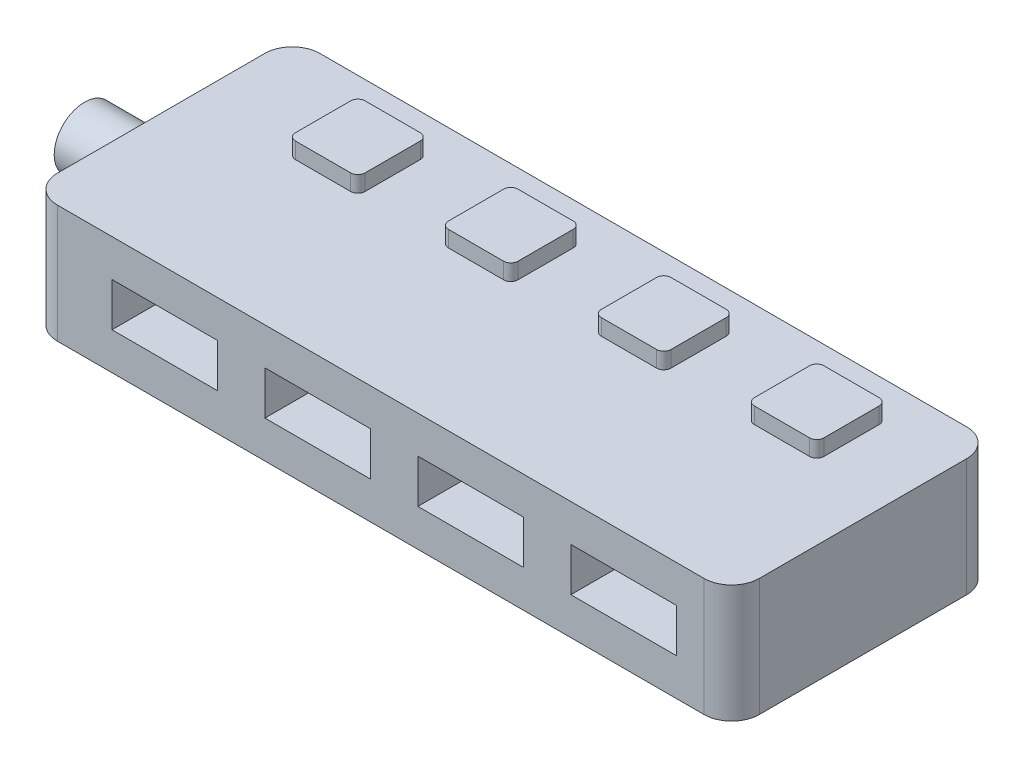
ISO-10303-21;
HEADER;
FILE_DESCRIPTION(('STEP AP214'),'2;1');
FILE_NAME('part.step','',(''),(''),'','','');
FILE_SCHEMA(('AUTOMOTIVE_DESIGN { 1 0 10303 214 1 1 1 1 }'));
ENDSEC;
DATA;
#1=APPLICATION_CONTEXT('core data for automotive mechanical design processes');
#2=APPLICATION_PROTOCOL_DEFINITION('international standard','automotive_design',2000,#1);
#3=PRODUCT_CONTEXT('',#1,'mechanical');
#4=PRODUCT('Part','Part','',(#3));
#5=PRODUCT_RELATED_PRODUCT_CATEGORY('part','',(#4));
#6=PRODUCT_DEFINITION_FORMATION('','',#4);
#7=PRODUCT_DEFINITION_CONTEXT('part definition',#1,'design');
#8=PRODUCT_DEFINITION('design','',#6,#7);
#9=PRODUCT_DEFINITION_SHAPE('','',#8);
#10=(LENGTH_UNIT() NAMED_UNIT(*) SI_UNIT(.MILLI.,.METRE.));
#11=(NAMED_UNIT(*) PLANE_ANGLE_UNIT() SI_UNIT($,.RADIAN.));
#12=(NAMED_UNIT(*) SI_UNIT($,.STERADIAN.) SOLID_ANGLE_UNIT());
#13=UNCERTAINTY_MEASURE_WITH_UNIT(LENGTH_MEASURE(1.E-05),#10,'distance_accuracy_value','');
#14=(GEOMETRIC_REPRESENTATION_CONTEXT(3) GLOBAL_UNCERTAINTY_ASSIGNED_CONTEXT((#13)) GLOBAL_UNIT_ASSIGNED_CONTEXT((#10,
#11,#12)) REPRESENTATION_CONTEXT('',''));
#15=CARTESIAN_POINT('',(0.,0.,0.));
#16=DIRECTION('',(0.,0.,1.));
#17=DIRECTION('',(1.,0.,0.));
#18=AXIS2_PLACEMENT_3D('',#15,#16,#17);
#19=CARTESIAN_POINT('',(3.302,14.097,0.));
#20=DIRECTION('',(0.,-1.,0.));
#21=DIRECTION('',(0.,0.,-1.));
#22=AXIS2_PLACEMENT_3D('',#19,#20,#21);
#23=PLANE('',#22);
#24=CARTESIAN_POINT('',(49.4120178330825,14.097,-16.4936178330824));
#25=DIRECTION('',(0.,1.,0.));
#26=DIRECTION('',(0.,0.,-1.));
#27=AXIS2_PLACEMENT_3D('',#24,#25,#26);
#28=CIRCLE('',#27,0.859917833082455);
#29=CARTESIAN_POINT('',(48.5521,14.097,-16.4936178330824));
#30=VERTEX_POINT('',#29);
#31=CARTESIAN_POINT('',(49.4120178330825,14.097,-15.6337));
#32=VERTEX_POINT('',#31);
#33=EDGE_CURVE('E585',#30,#32,#28,.T.);
#34=ORIENTED_EDGE('',*,*,#33,.F.);
#35=DIRECTION('',(0.,0.,1.));
#36=VECTOR('',#35,1.);
#37=CARTESIAN_POINT('',(48.5521,14.097,-16.4936178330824));
#38=LINE('',#37,#36);
#39=CARTESIAN_POINT('',(48.5521,14.097,-23.0922821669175));
#40=VERTEX_POINT('',#39);
#41=EDGE_CURVE('E590',#40,#30,#38,.T.);
#42=ORIENTED_EDGE('',*,*,#41,.F.);
#43=CARTESIAN_POINT('',(49.4120178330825,14.097,-23.0922821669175));
#44=DIRECTION('',(0.,1.,0.));
#45=DIRECTION('',(0.,0.,-1.));
#46=AXIS2_PLACEMENT_3D('',#43,#44,#45);
#47=CIRCLE('',#46,0.859917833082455);
#48=CARTESIAN_POINT('',(49.4120178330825,14.097,-23.9522));
#49=VERTEX_POINT('',#48);
#50=EDGE_CURVE('E622',#49,#40,#47,.T.);
#51=ORIENTED_EDGE('',*,*,#50,.F.);
#52=DIRECTION('',(-1.,0.,0.));
#53=VECTOR('',#52,1.);
#54=CARTESIAN_POINT('',(49.4120178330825,14.097,-23.9522));
#55=LINE('',#54,#53);
#56=CARTESIAN_POINT('',(56.0106821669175,14.097,-23.9522));
#57=VERTEX_POINT('',#56);
#58=EDGE_CURVE('E619',#57,#49,#55,.T.);
#59=ORIENTED_EDGE('',*,*,#58,.F.);
#60=CARTESIAN_POINT('',(56.0106821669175,14.097,-23.0922821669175));
#61=DIRECTION('',(0.,1.,0.));
#62=DIRECTION('',(0.,0.,-1.));
#63=AXIS2_PLACEMENT_3D('',#60,#61,#62);
#64=CIRCLE('',#63,0.859917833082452);
#65=CARTESIAN_POINT('',(56.8706,14.097,-23.0922821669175));
#66=VERTEX_POINT('',#65);
#67=EDGE_CURVE('E616',#66,#57,#64,.T.);
#68=ORIENTED_EDGE('',*,*,#67,.F.);
#69=DIRECTION('',(0.,0.,-1.));
#70=VECTOR('',#69,1.);
#71=CARTESIAN_POINT('',(56.8706,14.097,-23.0922821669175));
#72=LINE('',#71,#70);
#73=CARTESIAN_POINT('',(56.8706,14.097,-16.4936178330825));
#74=VERTEX_POINT('',#73);
#75=EDGE_CURVE('E613',#74,#66,#72,.T.);
#76=ORIENTED_EDGE('',*,*,#75,.F.);
#77=CARTESIAN_POINT('',(56.0106821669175,14.097,-16.4936178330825));
#78=DIRECTION('',(0.,1.,0.));
#79=DIRECTION('',(0.,0.,-1.));
#80=AXIS2_PLACEMENT_3D('',#77,#78,#79);
#81=CIRCLE('',#80,0.859917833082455);
#82=CARTESIAN_POINT('',(56.0106821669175,14.097,-15.6337));
#83=VERTEX_POINT('',#82);
#84=EDGE_CURVE('E610',#83,#74,#81,.T.);
#85=ORIENTED_EDGE('',*,*,#84,.F.);
#86=DIRECTION('',(1.,0.,0.));
#87=VECTOR('',#86,1.);
#88=CARTESIAN_POINT('',(56.0106821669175,14.097,-15.6337));
#89=LINE('',#88,#87);
#90=EDGE_CURVE('E607',#32,#83,#89,.T.);
#91=ORIENTED_EDGE('',*,*,#90,.F.);
#92=EDGE_LOOP('',(#34,#42,#51,#59,#68,#76,#85,#91));
#93=FACE_BOUND('',#92,.T.);
#94=CARTESIAN_POINT('',(12.8360178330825,14.097,-16.4936178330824));
#95=DIRECTION('',(0.,1.,0.));
#96=DIRECTION('',(0.,0.,-1.));
#97=AXIS2_PLACEMENT_3D('',#94,#95,#96);
#98=CIRCLE('',#97,0.859917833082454);
#99=CARTESIAN_POINT('',(11.9761,14.097,-16.4936178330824));
#100=VERTEX_POINT('',#99);
#101=CARTESIAN_POINT('',(12.8360178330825,14.097,-15.6337));
#102=VERTEX_POINT('',#101);
#103=EDGE_CURVE('E715',#100,#102,#98,.T.);
#104=ORIENTED_EDGE('',*,*,#103,.F.);
#105=DIRECTION('',(0.,0.,1.));
#106=VECTOR('',#105,1.);
#107=CARTESIAN_POINT('',(11.9761,14.097,-16.4936178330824));
#108=LINE('',#107,#106);
#109=CARTESIAN_POINT('',(11.9761,14.097,-23.0922821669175));
#110=VERTEX_POINT('',#109);
#111=EDGE_CURVE('E720',#110,#100,#108,.T.);
#112=ORIENTED_EDGE('',*,*,#111,.F.);
#113=CARTESIAN_POINT('',(12.8360178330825,14.097,-23.0922821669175));
#114=DIRECTION('',(0.,1.,0.));
#115=DIRECTION('',(0.,0.,-1.));
#116=AXIS2_PLACEMENT_3D('',#113,#114,#115);
#117=CIRCLE('',#116,0.859917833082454);
#118=CARTESIAN_POINT('',(12.8360178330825,14.097,-23.9522));
#119=VERTEX_POINT('',#118);
#120=EDGE_CURVE('E752',#119,#110,#117,.T.);
#121=ORIENTED_EDGE('',*,*,#120,.F.);
#122=DIRECTION('',(-1.,0.,0.));
#123=VECTOR('',#122,1.);
#124=CARTESIAN_POINT('',(12.8360178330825,14.097,-23.9522));
#125=LINE('',#124,#123);
#126=CARTESIAN_POINT('',(19.4346821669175,14.097,-23.9522));
#127=VERTEX_POINT('',#126);
#128=EDGE_CURVE('E749',#127,#119,#125,.T.);
#129=ORIENTED_EDGE('',*,*,#128,.F.);
#130=CARTESIAN_POINT('',(19.4346821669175,14.097,-23.0922821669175));
#131=DIRECTION('',(0.,1.,0.));
#132=DIRECTION('',(0.,0.,-1.));
#133=AXIS2_PLACEMENT_3D('',#130,#131,#132);
#134=CIRCLE('',#133,0.859917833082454);
#135=CARTESIAN_POINT('',(20.2946,14.097,-23.0922821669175));
#136=VERTEX_POINT('',#135);
#137=EDGE_CURVE('E746',#136,#127,#134,.T.);
#138=ORIENTED_EDGE('',*,*,#137,.F.);
#139=DIRECTION('',(0.,0.,-1.));
#140=VECTOR('',#139,1.);
#141=CARTESIAN_POINT('',(20.2946,14.097,-23.0922821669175));
#142=LINE('',#141,#140);
#143=CARTESIAN_POINT('',(20.2946,14.097,-16.4936178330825));
#144=VERTEX_POINT('',#143);
#145=EDGE_CURVE('E743',#144,#136,#142,.T.);
#146=ORIENTED_EDGE('',*,*,#145,.F.);
#147=CARTESIAN_POINT('',(19.4346821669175,14.097,-16.4936178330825));
#148=DIRECTION('',(0.,1.,0.));
#149=DIRECTION('',(0.,0.,-1.));
#150=AXIS2_PLACEMENT_3D('',#147,#148,#149);
#151=CIRCLE('',#150,0.859917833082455);
#152=CARTESIAN_POINT('',(19.4346821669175,14.097,-15.6337));
#153=VERTEX_POINT('',#152);
#154=EDGE_CURVE('E740',#153,#144,#151,.T.);
#155=ORIENTED_EDGE('',*,*,#154,.F.);
#156=DIRECTION('',(1.,0.,0.));
#157=VECTOR('',#156,1.);
#158=CARTESIAN_POINT('',(19.4346821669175,14.097,-15.6337));
#159=LINE('',#158,#157);
#160=EDGE_CURVE('E737',#102,#153,#159,.T.);
#161=ORIENTED_EDGE('',*,*,#160,.F.);
#162=EDGE_LOOP('',(#104,#112,#121,#129,#138,#146,#155,#161));
#163=FACE_BOUND('',#162,.T.);
#164=CARTESIAN_POINT('',(3.302,14.097,0.));
#165=DIRECTION('',(0.,1.,0.));
#166=DIRECTION('',(0.,0.,-1.));
#167=AXIS2_PLACEMENT_3D('',#164,#165,#166);
#168=CIRCLE('',#167,3.302);
#169=CARTESIAN_POINT('',(0.,14.097,0.));
#170=VERTEX_POINT('',#169);
#171=CARTESIAN_POINT('',(3.302,14.097,3.302));
#172=VERTEX_POINT('',#171);
#173=EDGE_CURVE('E781',#170,#172,#168,.T.);
#174=ORIENTED_EDGE('',*,*,#173,.T.);
#175=DIRECTION('',(1.,0.,0.));
#176=VECTOR('',#175,1.);
#177=CARTESIAN_POINT('',(80.6196,14.097,3.30199999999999));
#178=LINE('',#177,#176);
#179=CARTESIAN_POINT('',(80.6196,14.097,3.302));
#180=VERTEX_POINT('',#179);
#181=EDGE_CURVE('E784',#172,#180,#178,.T.);
#182=ORIENTED_EDGE('',*,*,#181,.T.);
#183=CARTESIAN_POINT('',(80.6196,14.097,0.));
#184=DIRECTION('',(0.,1.,0.));
#185=DIRECTION('',(0.,0.,-1.));
#186=AXIS2_PLACEMENT_3D('',#183,#184,#185);
#187=CIRCLE('',#186,3.30200000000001);
#188=CARTESIAN_POINT('',(83.9216,14.097,0.));
#189=VERTEX_POINT('',#188);
#190=EDGE_CURVE('E787',#180,#189,#187,.T.);
#191=ORIENTED_EDGE('',*,*,#190,.T.);
#192=DIRECTION('',(0.,0.,-1.));
#193=VECTOR('',#192,1.);
#194=CARTESIAN_POINT('',(83.9216,14.097,-24.7904));
#195=LINE('',#194,#193);
#196=CARTESIAN_POINT('',(83.9216,14.097,-24.7904));
#197=VERTEX_POINT('',#196);
#198=EDGE_CURVE('E789',#189,#197,#195,.T.);
#199=ORIENTED_EDGE('',*,*,#198,.T.);
#200=CARTESIAN_POINT('',(80.6196,14.097,-24.7904));
#201=DIRECTION('',(0.,1.,0.));
#202=DIRECTION('',(0.,0.,-1.));
#203=AXIS2_PLACEMENT_3D('',#200,#201,#202);
#204=CIRCLE('',#203,3.302);
#205=CARTESIAN_POINT('',(80.6196,14.097,-28.0924));
#206=VERTEX_POINT('',#205);
#207=EDGE_CURVE('E791',#197,#206,#204,.T.);
#208=ORIENTED_EDGE('',*,*,#207,.T.);
#209=DIRECTION('',(-1.,0.,0.));
#210=VECTOR('',#209,1.);
#211=CARTESIAN_POINT('',(3.302,14.097,-28.0924));
#212=LINE('',#211,#210);
#213=CARTESIAN_POINT('',(3.302,14.097,-28.0924));
#214=VERTEX_POINT('',#213);
#215=EDGE_CURVE('E793',#206,#214,#212,.T.);
#216=ORIENTED_EDGE('',*,*,#215,.T.);
#217=CARTESIAN_POINT('',(3.302,14.097,-24.7904));
#218=DIRECTION('',(0.,1.,0.));
#219=DIRECTION('',(0.,0.,-1.));
#220=AXIS2_PLACEMENT_3D('',#217,#218,#219);
#221=CIRCLE('',#220,3.302);
#222=CARTESIAN_POINT('',(0.,14.097,-24.7904));
#223=VERTEX_POINT('',#222);
#224=EDGE_CURVE('E795',#214,#223,#221,.T.);
#225=ORIENTED_EDGE('',*,*,#224,.T.);
#226=DIRECTION('',(0.,0.,1.));
#227=VECTOR('',#226,1.);
#228=CARTESIAN_POINT('',(0.,14.097,0.));
#229=LINE('',#228,#227);
#230=EDGE_CURVE('E797',#223,#170,#229,.T.);
#231=ORIENTED_EDGE('',*,*,#230,.T.);
#232=EDGE_LOOP('',(#174,#182,#191,#199,#208,#216,#225,#231));
#233=FACE_BOUND('',#232,.T.);
#234=CARTESIAN_POINT('',(31.1240178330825,14.097,-16.4936178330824));
#235=DIRECTION('',(0.,1.,0.));
#236=DIRECTION('',(0.,0.,-1.));
#237=AXIS2_PLACEMENT_3D('',#234,#235,#236);
#238=CIRCLE('',#237,0.859917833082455);
#239=CARTESIAN_POINT('',(30.2641,14.097,-16.4936178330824));
#240=VERTEX_POINT('',#239);
#241=CARTESIAN_POINT('',(31.1240178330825,14.097,-15.6337));
#242=VERTEX_POINT('',#241);
#243=EDGE_CURVE('E650',#240,#242,#238,.T.);
#244=ORIENTED_EDGE('',*,*,#243,.F.);
#245=DIRECTION('',(0.,0.,1.));
#246=VECTOR('',#245,1.);
#247=CARTESIAN_POINT('',(30.2641,14.097,-16.4936178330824));
#248=LINE('',#247,#246);
#249=CARTESIAN_POINT('',(30.2641,14.097,-23.0922821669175));
#250=VERTEX_POINT('',#249);
#251=EDGE_CURVE('E655',#250,#240,#248,.T.);
#252=ORIENTED_EDGE('',*,*,#251,.F.);
#253=CARTESIAN_POINT('',(31.1240178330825,14.097,-23.0922821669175));
#254=DIRECTION('',(0.,1.,0.));
#255=DIRECTION('',(0.,0.,-1.));
#256=AXIS2_PLACEMENT_3D('',#253,#254,#255);
#257=CIRCLE('',#256,0.859917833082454);
#258=CARTESIAN_POINT('',(31.1240178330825,14.097,-23.9522));
#259=VERTEX_POINT('',#258);
#260=EDGE_CURVE('E687',#259,#250,#257,.T.);
#261=ORIENTED_EDGE('',*,*,#260,.F.);
#262=DIRECTION('',(-1.,0.,0.));
#263=VECTOR('',#262,1.);
#264=CARTESIAN_POINT('',(31.1240178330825,14.097,-23.9522));
#265=LINE('',#264,#263);
#266=CARTESIAN_POINT('',(37.7226821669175,14.097,-23.9522));
#267=VERTEX_POINT('',#266);
#268=EDGE_CURVE('E684',#267,#259,#265,.T.);
#269=ORIENTED_EDGE('',*,*,#268,.F.);
#270=CARTESIAN_POINT('',(37.7226821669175,14.097,-23.0922821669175));
#271=DIRECTION('',(0.,1.,0.));
#272=DIRECTION('',(0.,0.,-1.));
#273=AXIS2_PLACEMENT_3D('',#270,#271,#272);
#274=CIRCLE('',#273,0.859917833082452);
#275=CARTESIAN_POINT('',(38.5826,14.097,-23.0922821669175));
#276=VERTEX_POINT('',#275);
#277=EDGE_CURVE('E681',#276,#267,#274,.T.);
#278=ORIENTED_EDGE('',*,*,#277,.F.);
#279=DIRECTION('',(0.,0.,-1.));
#280=VECTOR('',#279,1.);
#281=CARTESIAN_POINT('',(38.5826,14.097,-23.0922821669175));
#282=LINE('',#281,#280);
#283=CARTESIAN_POINT('',(38.5826,14.097,-16.4936178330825));
#284=VERTEX_POINT('',#283);
#285=EDGE_CURVE('E678',#284,#276,#282,.T.);
#286=ORIENTED_EDGE('',*,*,#285,.F.);
#287=CARTESIAN_POINT('',(37.7226821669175,14.097,-16.4936178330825));
#288=DIRECTION('',(0.,1.,0.));
#289=DIRECTION('',(0.,0.,-1.));
#290=AXIS2_PLACEMENT_3D('',#287,#288,#289);
#291=CIRCLE('',#290,0.859917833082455);
#292=CARTESIAN_POINT('',(37.7226821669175,14.097,-15.6337));
#293=VERTEX_POINT('',#292);
#294=EDGE_CURVE('E675',#293,#284,#291,.T.);
#295=ORIENTED_EDGE('',*,*,#294,.F.);
#296=DIRECTION('',(1.,0.,0.));
#297=VECTOR('',#296,1.);
#298=CARTESIAN_POINT('',(37.7226821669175,14.097,-15.6337));
#299=LINE('',#298,#297);
#300=EDGE_CURVE('E672',#242,#293,#299,.T.);
#301=ORIENTED_EDGE('',*,*,#300,.F.);
#302=EDGE_LOOP('',(#244,#252,#261,#269,#278,#286,#295,#301));
#303=FACE_BOUND('',#302,.T.);
#304=CARTESIAN_POINT('',(67.7000178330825,14.097,-16.4936178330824));
#305=DIRECTION('',(0.,1.,0.));
#306=DIRECTION('',(0.,0.,-1.));
#307=AXIS2_PLACEMENT_3D('',#304,#305,#306);
#308=CIRCLE('',#307,0.859917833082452);
#309=CARTESIAN_POINT('',(66.8401,14.097,-16.4936178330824));
#310=VERTEX_POINT('',#309);
#311=CARTESIAN_POINT('',(67.7000178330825,14.097,-15.6337));
#312=VERTEX_POINT('',#311);
#313=EDGE_CURVE('E514',#310,#312,#308,.T.);
#314=ORIENTED_EDGE('',*,*,#313,.F.);
#315=DIRECTION('',(0.,0.,1.));
#316=VECTOR('',#315,1.);
#317=CARTESIAN_POINT('',(66.8401,14.097,-16.4936178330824));
#318=LINE('',#317,#316);
#319=CARTESIAN_POINT('',(66.8401,14.097,-23.0922821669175));
#320=VERTEX_POINT('',#319);
#321=EDGE_CURVE('E525',#320,#310,#318,.T.);
#322=ORIENTED_EDGE('',*,*,#321,.F.);
#323=CARTESIAN_POINT('',(67.7000178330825,14.097,-23.0922821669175));
#324=DIRECTION('',(0.,1.,0.));
#325=DIRECTION('',(0.,0.,-1.));
#326=AXIS2_PLACEMENT_3D('',#323,#324,#325);
#327=CIRCLE('',#326,0.859917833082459);
#328=CARTESIAN_POINT('',(67.7000178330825,14.097,-23.9522));
#329=VERTEX_POINT('',#328);
#330=EDGE_CURVE('E557',#329,#320,#327,.T.);
#331=ORIENTED_EDGE('',*,*,#330,.F.);
#332=DIRECTION('',(-1.,0.,0.));
#333=VECTOR('',#332,1.);
#334=CARTESIAN_POINT('',(67.7000178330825,14.097,-23.9522));
#335=LINE('',#334,#333);
#336=CARTESIAN_POINT('',(74.2986821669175,14.097,-23.9522));
#337=VERTEX_POINT('',#336);
#338=EDGE_CURVE('E554',#337,#329,#335,.T.);
#339=ORIENTED_EDGE('',*,*,#338,.F.);
#340=CARTESIAN_POINT('',(74.2986821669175,14.097,-23.0922821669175));
#341=DIRECTION('',(0.,1.,0.));
#342=DIRECTION('',(0.,0.,-1.));
#343=AXIS2_PLACEMENT_3D('',#340,#341,#342);
#344=CIRCLE('',#343,0.859917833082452);
#345=CARTESIAN_POINT('',(75.1586,14.097,-23.0922821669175));
#346=VERTEX_POINT('',#345);
#347=EDGE_CURVE('E551',#346,#337,#344,.T.);
#348=ORIENTED_EDGE('',*,*,#347,.F.);
#349=DIRECTION('',(0.,0.,-1.));
#350=VECTOR('',#349,1.);
#351=CARTESIAN_POINT('',(75.1586,14.097,-23.0922821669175));
#352=LINE('',#351,#350);
#353=CARTESIAN_POINT('',(75.1586,14.097,-16.4936178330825));
#354=VERTEX_POINT('',#353);
#355=EDGE_CURVE('E548',#354,#346,#352,.T.);
#356=ORIENTED_EDGE('',*,*,#355,.F.);
#357=CARTESIAN_POINT('',(74.2986821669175,14.097,-16.4936178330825));
#358=DIRECTION('',(0.,1.,0.));
#359=DIRECTION('',(0.,0.,-1.));
#360=AXIS2_PLACEMENT_3D('',#357,#358,#359);
#361=CIRCLE('',#360,0.859917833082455);
#362=CARTESIAN_POINT('',(74.2986821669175,14.097,-15.6337));
#363=VERTEX_POINT('',#362);
#364=EDGE_CURVE('E545',#363,#354,#361,.T.);
#365=ORIENTED_EDGE('',*,*,#364,.F.);
#366=DIRECTION('',(1.,0.,0.));
#367=VECTOR('',#366,1.);
#368=CARTESIAN_POINT('',(74.2986821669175,14.097,-15.6337));
#369=LINE('',#368,#367);
#370=EDGE_CURVE('E542',#312,#363,#369,.T.);
#371=ORIENTED_EDGE('',*,*,#370,.F.);
#372=EDGE_LOOP('',(#314,#322,#331,#339,#348,#356,#365,#371));
#373=FACE_BOUND('',#372,.T.);
#374=ADVANCED_FACE('F33',(#93,#163,#233,#303,#373),#23,.F.);
#375=CARTESIAN_POINT('',(3.302,14.097,0.));
#376=DIRECTION('',(0.,-1.,0.));
#377=DIRECTION('',(0.,0.,-1.));
#378=AXIS2_PLACEMENT_3D('',#375,#376,#377);
#379=CYLINDRICAL_SURFACE('',#378,3.302);
#380=CARTESIAN_POINT('',(3.302,0.,0.));
#381=DIRECTION('',(0.,1.,0.));
#382=DIRECTION('',(0.,0.,-1.));
#383=AXIS2_PLACEMENT_3D('',#380,#381,#382);
#384=CIRCLE('',#383,3.302);
#385=CARTESIAN_POINT('',(0.,0.,0.));
#386=VERTEX_POINT('',#385);
#387=CARTESIAN_POINT('',(3.302,0.,3.302));
#388=VERTEX_POINT('',#387);
#389=EDGE_CURVE('E780',#386,#388,#384,.T.);
#390=ORIENTED_EDGE('',*,*,#389,.T.);
#391=DIRECTION('',(0.,-1.,0.));
#392=VECTOR('',#391,1.);
#393=CARTESIAN_POINT('',(3.302,14.097,3.302));
#394=LINE('',#393,#392);
#395=EDGE_CURVE('E41',#172,#388,#394,.T.);
#396=ORIENTED_EDGE('',*,*,#395,.F.);
#397=ORIENTED_EDGE('',*,*,#173,.F.);
#398=DIRECTION('',(0.,-1.,0.));
#399=VECTOR('',#398,1.);
#400=CARTESIAN_POINT('',(0.,14.097,0.));
#401=LINE('',#400,#399);
#402=EDGE_CURVE('E799',#170,#386,#401,.T.);
#403=ORIENTED_EDGE('',*,*,#402,.T.);
#404=EDGE_LOOP('',(#390,#396,#397,#403));
#405=FACE_BOUND('',#404,.T.);
#406=ADVANCED_FACE('F35',(#405),#379,.T.);
#407=CARTESIAN_POINT('',(80.6196,14.097,3.30199999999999));
#408=DIRECTION('',(0.,0.,-1.));
#409=DIRECTION('',(-1.,0.,0.));
#410=AXIS2_PLACEMENT_3D('',#407,#408,#409);
#411=PLANE('',#410);
#412=DIRECTION('',(1.,0.,0.));
#413=VECTOR('',#412,1.);
#414=CARTESIAN_POINT('',(28.1178,4.445,3.302));
#415=LINE('',#414,#413);
#416=CARTESIAN_POINT('',(28.1178,4.445,3.302));
#417=VERTEX_POINT('',#416);
#418=CARTESIAN_POINT('',(40.7289,4.445,3.302));
#419=VERTEX_POINT('',#418);
#420=EDGE_CURVE('E417',#417,#419,#415,.T.);
#421=ORIENTED_EDGE('',*,*,#420,.F.);
#422=DIRECTION('',(0.,-1.,0.));
#423=VECTOR('',#422,1.);
#424=CARTESIAN_POINT('',(28.1178,4.445,3.302));
#425=LINE('',#424,#423);
#426=CARTESIAN_POINT('',(28.1178,9.652,3.302));
#427=VERTEX_POINT('',#426);
#428=EDGE_CURVE('E48',#427,#417,#425,.T.);
#429=ORIENTED_EDGE('',*,*,#428,.F.);
#430=DIRECTION('',(-1.,0.,0.));
#431=VECTOR('',#430,1.);
#432=CARTESIAN_POINT('',(28.1178,9.652,3.302));
#433=LINE('',#432,#431);
#434=CARTESIAN_POINT('',(40.7289,9.652,3.302));
#435=VERTEX_POINT('',#434);
#436=EDGE_CURVE('E406',#435,#427,#433,.T.);
#437=ORIENTED_EDGE('',*,*,#436,.F.);
#438=DIRECTION('',(0.,1.,0.));
#439=VECTOR('',#438,1.);
#440=CARTESIAN_POINT('',(40.7289,4.445,3.302));
#441=LINE('',#440,#439);
#442=EDGE_CURVE('E409',#419,#435,#441,.T.);
#443=ORIENTED_EDGE('',*,*,#442,.F.);
#444=EDGE_LOOP('',(#421,#429,#437,#443));
#445=FACE_BOUND('',#444,.T.);
#446=DIRECTION('',(1.,0.,0.));
#447=VECTOR('',#446,1.);
#448=CARTESIAN_POINT('',(46.4058,4.445,3.302));
#449=LINE('',#448,#447);
#450=CARTESIAN_POINT('',(46.4058,4.445,3.30199999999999));
#451=VERTEX_POINT('',#450);
#452=CARTESIAN_POINT('',(59.0169,4.445,3.302));
#453=VERTEX_POINT('',#452);
#454=EDGE_CURVE('E443',#451,#453,#449,.T.);
#455=ORIENTED_EDGE('',*,*,#454,.F.);
#456=DIRECTION('',(0.,-1.,0.));
#457=VECTOR('',#456,1.);
#458=CARTESIAN_POINT('',(46.4058,4.445,3.302));
#459=LINE('',#458,#457);
#460=CARTESIAN_POINT('',(46.4058,9.652,3.302));
#461=VERTEX_POINT('',#460);
#462=EDGE_CURVE('E56',#461,#451,#459,.T.);
#463=ORIENTED_EDGE('',*,*,#462,.F.);
#464=DIRECTION('',(-1.,0.,0.));
#465=VECTOR('',#464,1.);
#466=CARTESIAN_POINT('',(46.4058,9.652,3.302));
#467=LINE('',#466,#465);
#468=CARTESIAN_POINT('',(59.0169,9.652,3.302));
#469=VERTEX_POINT('',#468);
#470=EDGE_CURVE('E432',#469,#461,#467,.T.);
#471=ORIENTED_EDGE('',*,*,#470,.F.);
#472=DIRECTION('',(0.,1.,0.));
#473=VECTOR('',#472,1.);
#474=CARTESIAN_POINT('',(59.0169,4.445,3.302));
#475=LINE('',#474,#473);
#476=EDGE_CURVE('E447',#453,#469,#475,.T.);
#477=ORIENTED_EDGE('',*,*,#476,.F.);
#478=EDGE_LOOP('',(#455,#463,#471,#477));
#479=FACE_BOUND('',#478,.T.);
#480=DIRECTION('',(1.,0.,0.));
#481=VECTOR('',#480,1.);
#482=CARTESIAN_POINT('',(64.6938,4.445,3.302));
#483=LINE('',#482,#481);
#484=CARTESIAN_POINT('',(64.6938,4.445,3.30199999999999));
#485=VERTEX_POINT('',#484);
#486=CARTESIAN_POINT('',(77.3049,4.445,3.302));
#487=VERTEX_POINT('',#486);
#488=EDGE_CURVE('E474',#485,#487,#483,.T.);
#489=ORIENTED_EDGE('',*,*,#488,.F.);
#490=DIRECTION('',(0.,-1.,0.));
#491=VECTOR('',#490,1.);
#492=CARTESIAN_POINT('',(64.6938,4.445,3.302));
#493=LINE('',#492,#491);
#494=CARTESIAN_POINT('',(64.6938,9.652,3.302));
#495=VERTEX_POINT('',#494);
#496=EDGE_CURVE('E472',#495,#485,#493,.T.);
#497=ORIENTED_EDGE('',*,*,#496,.F.);
#498=DIRECTION('',(-1.,0.,0.));
#499=VECTOR('',#498,1.);
#500=CARTESIAN_POINT('',(64.6938,9.652,3.302));
#501=LINE('',#500,#499);
#502=CARTESIAN_POINT('',(77.3049,9.652,3.302));
#503=VERTEX_POINT('',#502);
#504=EDGE_CURVE('E462',#503,#495,#501,.T.);
#505=ORIENTED_EDGE('',*,*,#504,.F.);
#506=DIRECTION('',(0.,1.,0.));
#507=VECTOR('',#506,1.);
#508=CARTESIAN_POINT('',(77.3049,4.445,3.302));
#509=LINE('',#508,#507);
#510=EDGE_CURVE('E477',#487,#503,#509,.T.);
#511=ORIENTED_EDGE('',*,*,#510,.F.);
#512=EDGE_LOOP('',(#489,#497,#505,#511));
#513=FACE_BOUND('',#512,.T.);
#514=DIRECTION('',(1.,0.,0.));
#515=VECTOR('',#514,1.);
#516=CARTESIAN_POINT('',(9.8298,4.445,3.302));
#517=LINE('',#516,#515);
#518=CARTESIAN_POINT('',(9.8298,4.445,3.302));
#519=VERTEX_POINT('',#518);
#520=CARTESIAN_POINT('',(22.4409,4.445,3.302));
#521=VERTEX_POINT('',#520);
#522=EDGE_CURVE('E504',#519,#521,#517,.T.);
#523=ORIENTED_EDGE('',*,*,#522,.F.);
#524=DIRECTION('',(0.,-1.,0.));
#525=VECTOR('',#524,1.);
#526=CARTESIAN_POINT('',(9.8298,4.445,3.302));
#527=LINE('',#526,#525);
#528=CARTESIAN_POINT('',(9.8298,9.652,3.302));
#529=VERTEX_POINT('',#528);
#530=EDGE_CURVE('E424',#529,#519,#527,.T.);
#531=ORIENTED_EDGE('',*,*,#530,.F.);
#532=DIRECTION('',(-1.,0.,0.));
#533=VECTOR('',#532,1.);
#534=CARTESIAN_POINT('',(9.8298,9.652,3.302));
#535=LINE('',#534,#533);
#536=CARTESIAN_POINT('',(22.4409,9.652,3.302));
#537=VERTEX_POINT('',#536);
#538=EDGE_CURVE('E493',#537,#529,#535,.T.);
#539=ORIENTED_EDGE('',*,*,#538,.F.);
#540=DIRECTION('',(0.,1.,0.));
#541=VECTOR('',#540,1.);
#542=CARTESIAN_POINT('',(22.4409,4.445,3.302));
#543=LINE('',#542,#541);
#544=EDGE_CURVE('E507',#521,#537,#543,.T.);
#545=ORIENTED_EDGE('',*,*,#544,.F.);
#546=EDGE_LOOP('',(#523,#531,#539,#545));
#547=FACE_BOUND('',#546,.T.);
#548=DIRECTION('',(1.,0.,0.));
#549=VECTOR('',#548,1.);
#550=CARTESIAN_POINT('',(80.6196,0.,3.30199999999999));
#551=LINE('',#550,#549);
#552=CARTESIAN_POINT('',(80.6196,0.,3.302));
#553=VERTEX_POINT('',#552);
#554=EDGE_CURVE('E802',#388,#553,#551,.T.);
#555=ORIENTED_EDGE('',*,*,#554,.T.);
#556=DIRECTION('',(0.,-1.,0.));
#557=VECTOR('',#556,1.);
#558=CARTESIAN_POINT('',(80.6196,14.097,3.302));
#559=LINE('',#558,#557);
#560=EDGE_CURVE('E832',#180,#553,#559,.T.);
#561=ORIENTED_EDGE('',*,*,#560,.F.);
#562=ORIENTED_EDGE('',*,*,#181,.F.);
#563=ORIENTED_EDGE('',*,*,#395,.T.);
#564=EDGE_LOOP('',(#555,#561,#562,#563));
#565=FACE_BOUND('',#564,.T.);
#566=ADVANCED_FACE('F837',(#445,#479,#513,#547,#565),#411,.F.);
#567=CARTESIAN_POINT('',(80.6196,14.097,0.));
#568=DIRECTION('',(0.,-1.,0.));
#569=DIRECTION('',(0.,0.,-1.));
#570=AXIS2_PLACEMENT_3D('',#567,#568,#569);
#571=CYLINDRICAL_SURFACE('',#570,3.30200000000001);
#572=CARTESIAN_POINT('',(80.6196,0.,0.));
#573=DIRECTION('',(0.,1.,0.));
#574=DIRECTION('',(0.,0.,-1.));
#575=AXIS2_PLACEMENT_3D('',#572,#573,#574);
#576=CIRCLE('',#575,3.30200000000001);
#577=CARTESIAN_POINT('',(83.9216,0.,0.));
#578=VERTEX_POINT('',#577);
#579=EDGE_CURVE('E804',#553,#578,#576,.T.);
#580=ORIENTED_EDGE('',*,*,#579,.T.);
#581=DIRECTION('',(0.,-1.,0.));
#582=VECTOR('',#581,1.);
#583=CARTESIAN_POINT('',(83.9216,14.097,0.));
#584=LINE('',#583,#582);
#585=EDGE_CURVE('E829',#189,#578,#584,.T.);
#586=ORIENTED_EDGE('',*,*,#585,.F.);
#587=ORIENTED_EDGE('',*,*,#190,.F.);
#588=ORIENTED_EDGE('',*,*,#560,.T.);
#589=EDGE_LOOP('',(#580,#586,#587,#588));
#590=FACE_BOUND('',#589,.T.);
#591=ADVANCED_FACE('F852',(#590),#571,.T.);
#592=CARTESIAN_POINT('',(83.9216,14.097,-24.7904));
#593=DIRECTION('',(-1.,0.,0.));
#594=DIRECTION('',(0.,0.,1.));
#595=AXIS2_PLACEMENT_3D('',#592,#593,#594);
#596=PLANE('',#595);
#597=DIRECTION('',(0.,0.,-1.));
#598=VECTOR('',#597,1.);
#599=CARTESIAN_POINT('',(83.9216,0.,-24.7904));
#600=LINE('',#599,#598);
#601=CARTESIAN_POINT('',(83.9216,0.,-24.7904));
#602=VERTEX_POINT('',#601);
#603=EDGE_CURVE('E806',#578,#602,#600,.T.);
#604=ORIENTED_EDGE('',*,*,#603,.T.);
#605=DIRECTION('',(0.,-1.,0.));
#606=VECTOR('',#605,1.);
#607=CARTESIAN_POINT('',(83.9216,14.097,-24.7904));
#608=LINE('',#607,#606);
#609=EDGE_CURVE('E826',#197,#602,#608,.T.);
#610=ORIENTED_EDGE('',*,*,#609,.F.);
#611=ORIENTED_EDGE('',*,*,#198,.F.);
#612=ORIENTED_EDGE('',*,*,#585,.T.);
#613=EDGE_LOOP('',(#604,#610,#611,#612));
#614=FACE_BOUND('',#613,.T.);
#615=ADVANCED_FACE('F856',(#614),#596,.F.);
#616=CARTESIAN_POINT('',(80.6196,14.097,-24.7904));
#617=DIRECTION('',(0.,-1.,0.));
#618=DIRECTION('',(0.,0.,-1.));
#619=AXIS2_PLACEMENT_3D('',#616,#617,#618);
#620=CYLINDRICAL_SURFACE('',#619,3.302);
#621=CARTESIAN_POINT('',(80.6196,0.,-24.7904));
#622=DIRECTION('',(0.,1.,0.));
#623=DIRECTION('',(0.,0.,-1.));
#624=AXIS2_PLACEMENT_3D('',#621,#622,#623);
#625=CIRCLE('',#624,3.302);
#626=CARTESIAN_POINT('',(80.6196,0.,-28.0924));
#627=VERTEX_POINT('',#626);
#628=EDGE_CURVE('E808',#602,#627,#625,.T.);
#629=ORIENTED_EDGE('',*,*,#628,.T.);
#630=DIRECTION('',(0.,-1.,0.));
#631=VECTOR('',#630,1.);
#632=CARTESIAN_POINT('',(80.6196,14.097,-28.0924));
#633=LINE('',#632,#631);
#634=EDGE_CURVE('E823',#206,#627,#633,.T.);
#635=ORIENTED_EDGE('',*,*,#634,.F.);
#636=ORIENTED_EDGE('',*,*,#207,.F.);
#637=ORIENTED_EDGE('',*,*,#609,.T.);
#638=EDGE_LOOP('',(#629,#635,#636,#637));
#639=FACE_BOUND('',#638,.T.);
#640=ADVANCED_FACE('F875',(#639),#620,.T.);
#641=CARTESIAN_POINT('',(3.302,14.097,-28.0924));
#642=DIRECTION('',(0.,0.,1.));
#643=DIRECTION('',(1.,0.,0.));
#644=AXIS2_PLACEMENT_3D('',#641,#642,#643);
#645=PLANE('',#644);
#646=DIRECTION('',(-1.,0.,0.));
#647=VECTOR('',#646,1.);
#648=CARTESIAN_POINT('',(3.302,0.,-28.0924));
#649=LINE('',#648,#647);
#650=CARTESIAN_POINT('',(3.302,0.,-28.0924));
#651=VERTEX_POINT('',#650);
#652=EDGE_CURVE('E810',#627,#651,#649,.T.);
#653=ORIENTED_EDGE('',*,*,#652,.T.);
#654=DIRECTION('',(0.,-1.,0.));
#655=VECTOR('',#654,1.);
#656=CARTESIAN_POINT('',(3.302,14.097,-28.0924));
#657=LINE('',#656,#655);
#658=EDGE_CURVE('E820',#214,#651,#657,.T.);
#659=ORIENTED_EDGE('',*,*,#658,.F.);
#660=ORIENTED_EDGE('',*,*,#215,.F.);
#661=ORIENTED_EDGE('',*,*,#634,.T.);
#662=EDGE_LOOP('',(#653,#659,#660,#661));
#663=FACE_BOUND('',#662,.T.);
#664=ADVANCED_FACE('F872',(#663),#645,.F.);
#665=CARTESIAN_POINT('',(3.302,14.097,-24.7904));
#666=DIRECTION('',(0.,-1.,0.));
#667=DIRECTION('',(0.,0.,-1.));
#668=AXIS2_PLACEMENT_3D('',#665,#666,#667);
#669=CYLINDRICAL_SURFACE('',#668,3.302);
#670=CARTESIAN_POINT('',(3.302,0.,-24.7904));
#671=DIRECTION('',(0.,1.,0.));
#672=DIRECTION('',(0.,0.,-1.));
#673=AXIS2_PLACEMENT_3D('',#670,#671,#672);
#674=CIRCLE('',#673,3.302);
#675=CARTESIAN_POINT('',(0.,0.,-24.7904));
#676=VERTEX_POINT('',#675);
#677=EDGE_CURVE('E812',#651,#676,#674,.T.);
#678=ORIENTED_EDGE('',*,*,#677,.T.);
#679=DIRECTION('',(0.,-1.,0.));
#680=VECTOR('',#679,1.);
#681=CARTESIAN_POINT('',(0.,14.097,-24.7904));
#682=LINE('',#681,#680);
#683=EDGE_CURVE('E817',#223,#676,#682,.T.);
#684=ORIENTED_EDGE('',*,*,#683,.F.);
#685=ORIENTED_EDGE('',*,*,#224,.F.);
#686=ORIENTED_EDGE('',*,*,#658,.T.);
#687=EDGE_LOOP('',(#678,#684,#685,#686));
#688=FACE_BOUND('',#687,.T.);
#689=ADVANCED_FACE('F868',(#688),#669,.T.);
#690=CARTESIAN_POINT('',(0.,14.097,0.));
#691=DIRECTION('',(1.,0.,0.));
#692=DIRECTION('',(0.,0.,-1.));
#693=AXIS2_PLACEMENT_3D('',#690,#691,#692);
#694=PLANE('',#693);
#695=CARTESIAN_POINT('',(0.,7.0485,-12.3952));
#696=DIRECTION('',(1.,0.,0.));
#697=DIRECTION('',(0.,0.,-1.));
#698=AXIS2_PLACEMENT_3D('',#695,#696,#697);
#699=CIRCLE('',#698,3.6322);
#700=CARTESIAN_POINT('',(0.,7.0485,-16.0274));
#701=VERTEX_POINT('',#700);
#702=EDGE_CURVE('E11',#701,#701,#699,.F.);
#703=ORIENTED_EDGE('',*,*,#702,.F.);
#704=EDGE_LOOP('',(#703));
#705=FACE_BOUND('',#704,.T.);
#706=DIRECTION('',(0.,0.,1.));
#707=VECTOR('',#706,1.);
#708=CARTESIAN_POINT('',(0.,0.,0.));
#709=LINE('',#708,#707);
#710=EDGE_CURVE('E785',#676,#386,#709,.T.);
#711=ORIENTED_EDGE('',*,*,#710,.T.);
#712=ORIENTED_EDGE('',*,*,#402,.F.);
#713=ORIENTED_EDGE('',*,*,#230,.F.);
#714=ORIENTED_EDGE('',*,*,#683,.T.);
#715=EDGE_LOOP('',(#711,#712,#713,#714));
#716=FACE_BOUND('',#715,.T.);
#717=ADVANCED_FACE('F866',(#705,#716),#694,.F.);
#718=CARTESIAN_POINT('',(3.302,0.,0.));
#719=DIRECTION('',(0.,-1.,0.));
#720=DIRECTION('',(0.,0.,-1.));
#721=AXIS2_PLACEMENT_3D('',#718,#719,#720);
#722=PLANE('',#721);
#723=ORIENTED_EDGE('',*,*,#389,.F.);
#724=ORIENTED_EDGE('',*,*,#710,.F.);
#725=ORIENTED_EDGE('',*,*,#677,.F.);
#726=ORIENTED_EDGE('',*,*,#652,.F.);
#727=ORIENTED_EDGE('',*,*,#628,.F.);
#728=ORIENTED_EDGE('',*,*,#603,.F.);
#729=ORIENTED_EDGE('',*,*,#579,.F.);
#730=ORIENTED_EDGE('',*,*,#554,.F.);
#731=EDGE_LOOP('',(#723,#724,#725,#726,#727,#728,#729,#730));
#732=FACE_BOUND('',#731,.T.);
#733=ADVANCED_FACE('F845',(#732),#722,.T.);
#734=CARTESIAN_POINT('',(12.8360178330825,16.0274,-16.4936178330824));
#735=DIRECTION('',(0.,-1.,0.));
#736=DIRECTION('',(0.,0.,-1.));
#737=AXIS2_PLACEMENT_3D('',#734,#735,#736);
#738=CYLINDRICAL_SURFACE('',#737,0.859917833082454);
#739=ORIENTED_EDGE('',*,*,#103,.T.);
#740=DIRECTION('',(0.,-1.,0.));
#741=VECTOR('',#740,1.);
#742=CARTESIAN_POINT('',(12.8360178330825,16.0274,-15.6337));
#743=LINE('',#742,#741);
#744=CARTESIAN_POINT('',(12.8360178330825,16.0274,-15.6337));
#745=VERTEX_POINT('',#744);
#746=EDGE_CURVE('E777',#745,#102,#743,.T.);
#747=ORIENTED_EDGE('',*,*,#746,.F.);
#748=CARTESIAN_POINT('',(12.8360178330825,16.0274,-16.4936178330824));
#749=DIRECTION('',(0.,1.,0.));
#750=DIRECTION('',(0.,0.,-1.));
#751=AXIS2_PLACEMENT_3D('',#748,#749,#750);
#752=CIRCLE('',#751,0.859917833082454);
#753=CARTESIAN_POINT('',(11.9761,16.0274,-16.4936178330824));
#754=VERTEX_POINT('',#753);
#755=EDGE_CURVE('E716',#754,#745,#752,.T.);
#756=ORIENTED_EDGE('',*,*,#755,.F.);
#757=DIRECTION('',(0.,-1.,0.));
#758=VECTOR('',#757,1.);
#759=CARTESIAN_POINT('',(11.9761,16.0274,-16.4936178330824));
#760=LINE('',#759,#758);
#761=EDGE_CURVE('E734',#754,#100,#760,.T.);
#762=ORIENTED_EDGE('',*,*,#761,.T.);
#763=EDGE_LOOP('',(#739,#747,#756,#762));
#764=FACE_BOUND('',#763,.T.);
#765=ADVANCED_FACE('F893',(#764),#738,.T.);
#766=CARTESIAN_POINT('',(19.4346821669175,16.0274,-15.6337));
#767=DIRECTION('',(0.,0.,-1.));
#768=DIRECTION('',(-1.,0.,0.));
#769=AXIS2_PLACEMENT_3D('',#766,#767,#768);
#770=PLANE('',#769);
#771=ORIENTED_EDGE('',*,*,#160,.T.);
#772=DIRECTION('',(0.,-1.,0.));
#773=VECTOR('',#772,1.);
#774=CARTESIAN_POINT('',(19.4346821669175,16.0274,-15.6337));
#775=LINE('',#774,#773);
#776=CARTESIAN_POINT('',(19.4346821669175,16.0274,-15.6337));
#777=VERTEX_POINT('',#776);
#778=EDGE_CURVE('E774',#777,#153,#775,.T.);
#779=ORIENTED_EDGE('',*,*,#778,.F.);
#780=DIRECTION('',(1.,0.,0.));
#781=VECTOR('',#780,1.);
#782=CARTESIAN_POINT('',(19.4346821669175,16.0274,-15.6337));
#783=LINE('',#782,#781);
#784=EDGE_CURVE('E719',#745,#777,#783,.T.);
#785=ORIENTED_EDGE('',*,*,#784,.F.);
#786=ORIENTED_EDGE('',*,*,#746,.T.);
#787=EDGE_LOOP('',(#771,#779,#785,#786));
#788=FACE_BOUND('',#787,.T.);
#789=ADVANCED_FACE('F921',(#788),#770,.F.);
#790=CARTESIAN_POINT('',(19.4346821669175,16.0274,-16.4936178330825));
#791=DIRECTION('',(0.,-1.,0.));
#792=DIRECTION('',(0.,0.,-1.));
#793=AXIS2_PLACEMENT_3D('',#790,#791,#792);
#794=CYLINDRICAL_SURFACE('',#793,0.859917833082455);
#795=ORIENTED_EDGE('',*,*,#154,.T.);
#796=DIRECTION('',(0.,-1.,0.));
#797=VECTOR('',#796,1.);
#798=CARTESIAN_POINT('',(20.2946,16.0274,-16.4936178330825));
#799=LINE('',#798,#797);
#800=CARTESIAN_POINT('',(20.2946,16.0274,-16.4936178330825));
#801=VERTEX_POINT('',#800);
#802=EDGE_CURVE('E771',#801,#144,#799,.T.);
#803=ORIENTED_EDGE('',*,*,#802,.F.);
#804=CARTESIAN_POINT('',(19.4346821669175,16.0274,-16.4936178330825));
#805=DIRECTION('',(0.,1.,0.));
#806=DIRECTION('',(0.,0.,-1.));
#807=AXIS2_PLACEMENT_3D('',#804,#805,#806);
#808=CIRCLE('',#807,0.859917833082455);
#809=EDGE_CURVE('E722',#777,#801,#808,.T.);
#810=ORIENTED_EDGE('',*,*,#809,.F.);
#811=ORIENTED_EDGE('',*,*,#778,.T.);
#812=EDGE_LOOP('',(#795,#803,#810,#811));
#813=FACE_BOUND('',#812,.T.);
#814=ADVANCED_FACE('F928',(#813),#794,.T.);
#815=CARTESIAN_POINT('',(20.2946,16.0274,-23.0922821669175));
#816=DIRECTION('',(-1.,0.,0.));
#817=DIRECTION('',(0.,0.,1.));
#818=AXIS2_PLACEMENT_3D('',#815,#816,#817);
#819=PLANE('',#818);
#820=ORIENTED_EDGE('',*,*,#145,.T.);
#821=DIRECTION('',(0.,-1.,0.));
#822=VECTOR('',#821,1.);
#823=CARTESIAN_POINT('',(20.2946,16.0274,-23.0922821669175));
#824=LINE('',#823,#822);
#825=CARTESIAN_POINT('',(20.2946,16.0274,-23.0922821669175));
#826=VERTEX_POINT('',#825);
#827=EDGE_CURVE('E768',#826,#136,#824,.T.);
#828=ORIENTED_EDGE('',*,*,#827,.F.);
#829=DIRECTION('',(0.,0.,-1.));
#830=VECTOR('',#829,1.);
#831=CARTESIAN_POINT('',(20.2946,16.0274,-23.0922821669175));
#832=LINE('',#831,#830);
#833=EDGE_CURVE('E724',#801,#826,#832,.T.);
#834=ORIENTED_EDGE('',*,*,#833,.F.);
#835=ORIENTED_EDGE('',*,*,#802,.T.);
#836=EDGE_LOOP('',(#820,#828,#834,#835));
#837=FACE_BOUND('',#836,.T.);
#838=ADVANCED_FACE('F935',(#837),#819,.F.);
#839=CARTESIAN_POINT('',(19.4346821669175,16.0274,-23.0922821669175));
#840=DIRECTION('',(0.,-1.,0.));
#841=DIRECTION('',(0.,0.,-1.));
#842=AXIS2_PLACEMENT_3D('',#839,#840,#841);
#843=CYLINDRICAL_SURFACE('',#842,0.859917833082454);
#844=ORIENTED_EDGE('',*,*,#137,.T.);
#845=DIRECTION('',(0.,-1.,0.));
#846=VECTOR('',#845,1.);
#847=CARTESIAN_POINT('',(19.4346821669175,16.0274,-23.9522));
#848=LINE('',#847,#846);
#849=CARTESIAN_POINT('',(19.4346821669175,16.0274,-23.9522));
#850=VERTEX_POINT('',#849);
#851=EDGE_CURVE('E765',#850,#127,#848,.T.);
#852=ORIENTED_EDGE('',*,*,#851,.F.);
#853=CARTESIAN_POINT('',(19.4346821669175,16.0274,-23.0922821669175));
#854=DIRECTION('',(0.,1.,0.));
#855=DIRECTION('',(0.,0.,-1.));
#856=AXIS2_PLACEMENT_3D('',#853,#854,#855);
#857=CIRCLE('',#856,0.859917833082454);
#858=EDGE_CURVE('E726',#826,#850,#857,.T.);
#859=ORIENTED_EDGE('',*,*,#858,.F.);
#860=ORIENTED_EDGE('',*,*,#827,.T.);
#861=EDGE_LOOP('',(#844,#852,#859,#860));
#862=FACE_BOUND('',#861,.T.);
#863=ADVANCED_FACE('F943',(#862),#843,.T.);
#864=CARTESIAN_POINT('',(12.8360178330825,16.0274,-23.9522));
#865=DIRECTION('',(0.,0.,1.));
#866=DIRECTION('',(1.,0.,0.));
#867=AXIS2_PLACEMENT_3D('',#864,#865,#866);
#868=PLANE('',#867);
#869=ORIENTED_EDGE('',*,*,#128,.T.);
#870=DIRECTION('',(0.,-1.,0.));
#871=VECTOR('',#870,1.);
#872=CARTESIAN_POINT('',(12.8360178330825,16.0274,-23.9522));
#873=LINE('',#872,#871);
#874=CARTESIAN_POINT('',(12.8360178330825,16.0274,-23.9522));
#875=VERTEX_POINT('',#874);
#876=EDGE_CURVE('E762',#875,#119,#873,.T.);
#877=ORIENTED_EDGE('',*,*,#876,.F.);
#878=DIRECTION('',(-1.,0.,0.));
#879=VECTOR('',#878,1.);
#880=CARTESIAN_POINT('',(12.8360178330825,16.0274,-23.9522));
#881=LINE('',#880,#879);
#882=EDGE_CURVE('E728',#850,#875,#881,.T.);
#883=ORIENTED_EDGE('',*,*,#882,.F.);
#884=ORIENTED_EDGE('',*,*,#851,.T.);
#885=EDGE_LOOP('',(#869,#877,#883,#884));
#886=FACE_BOUND('',#885,.T.);
#887=ADVANCED_FACE('F951',(#886),#868,.F.);
#888=CARTESIAN_POINT('',(12.8360178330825,16.0274,-23.0922821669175));
#889=DIRECTION('',(0.,-1.,0.));
#890=DIRECTION('',(0.,0.,-1.));
#891=AXIS2_PLACEMENT_3D('',#888,#889,#890);
#892=CYLINDRICAL_SURFACE('',#891,0.859917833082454);
#893=ORIENTED_EDGE('',*,*,#120,.T.);
#894=DIRECTION('',(0.,-1.,0.));
#895=VECTOR('',#894,1.);
#896=CARTESIAN_POINT('',(11.9761,16.0274,-23.0922821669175));
#897=LINE('',#896,#895);
#898=CARTESIAN_POINT('',(11.9761,16.0274,-23.0922821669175));
#899=VERTEX_POINT('',#898);
#900=EDGE_CURVE('E759',#899,#110,#897,.T.);
#901=ORIENTED_EDGE('',*,*,#900,.F.);
#902=CARTESIAN_POINT('',(12.8360178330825,16.0274,-23.0922821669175));
#903=DIRECTION('',(0.,1.,0.));
#904=DIRECTION('',(0.,0.,-1.));
#905=AXIS2_PLACEMENT_3D('',#902,#903,#904);
#906=CIRCLE('',#905,0.859917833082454);
#907=EDGE_CURVE('E730',#875,#899,#906,.T.);
#908=ORIENTED_EDGE('',*,*,#907,.F.);
#909=ORIENTED_EDGE('',*,*,#876,.T.);
#910=EDGE_LOOP('',(#893,#901,#908,#909));
#911=FACE_BOUND('',#910,.T.);
#912=ADVANCED_FACE('F959',(#911),#892,.T.);
#913=CARTESIAN_POINT('',(11.9761,16.0274,-16.4936178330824));
#914=DIRECTION('',(1.,0.,0.));
#915=DIRECTION('',(0.,0.,-1.));
#916=AXIS2_PLACEMENT_3D('',#913,#914,#915);
#917=PLANE('',#916);
#918=ORIENTED_EDGE('',*,*,#111,.T.);
#919=ORIENTED_EDGE('',*,*,#761,.F.);
#920=DIRECTION('',(0.,0.,1.));
#921=VECTOR('',#920,1.);
#922=CARTESIAN_POINT('',(11.9761,16.0274,-16.4936178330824));
#923=LINE('',#922,#921);
#924=EDGE_CURVE('E732',#899,#754,#923,.T.);
#925=ORIENTED_EDGE('',*,*,#924,.F.);
#926=ORIENTED_EDGE('',*,*,#900,.T.);
#927=EDGE_LOOP('',(#918,#919,#925,#926));
#928=FACE_BOUND('',#927,.T.);
#929=ADVANCED_FACE('F967',(#928),#917,.F.);
#930=CARTESIAN_POINT('',(12.8360178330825,16.0274,-16.4936178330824));
#931=DIRECTION('',(0.,-1.,0.));
#932=DIRECTION('',(0.,0.,-1.));
#933=AXIS2_PLACEMENT_3D('',#930,#931,#932);
#934=PLANE('',#933);
#935=ORIENTED_EDGE('',*,*,#755,.T.);
#936=ORIENTED_EDGE('',*,*,#784,.T.);
#937=ORIENTED_EDGE('',*,*,#809,.T.);
#938=ORIENTED_EDGE('',*,*,#833,.T.);
#939=ORIENTED_EDGE('',*,*,#858,.T.);
#940=ORIENTED_EDGE('',*,*,#882,.T.);
#941=ORIENTED_EDGE('',*,*,#907,.T.);
#942=ORIENTED_EDGE('',*,*,#924,.T.);
#943=EDGE_LOOP('',(#935,#936,#937,#938,#939,#940,#941,#942));
#944=FACE_BOUND('',#943,.T.);
#945=ADVANCED_FACE('F975',(#944),#934,.F.);
#946=CARTESIAN_POINT('',(31.1240178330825,16.0274,-16.4936178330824));
#947=DIRECTION('',(0.,-1.,0.));
#948=DIRECTION('',(0.,0.,-1.));
#949=AXIS2_PLACEMENT_3D('',#946,#947,#948);
#950=CYLINDRICAL_SURFACE('',#949,0.859917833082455);
#951=ORIENTED_EDGE('',*,*,#243,.T.);
#952=DIRECTION('',(0.,-1.,0.));
#953=VECTOR('',#952,1.);
#954=CARTESIAN_POINT('',(31.1240178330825,16.0274,-15.6337));
#955=LINE('',#954,#953);
#956=CARTESIAN_POINT('',(31.1240178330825,16.0274,-15.6337));
#957=VERTEX_POINT('',#956);
#958=EDGE_CURVE('E712',#957,#242,#955,.T.);
#959=ORIENTED_EDGE('',*,*,#958,.F.);
#960=CARTESIAN_POINT('',(31.1240178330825,16.0274,-16.4936178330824));
#961=DIRECTION('',(0.,1.,0.));
#962=DIRECTION('',(0.,0.,-1.));
#963=AXIS2_PLACEMENT_3D('',#960,#961,#962);
#964=CIRCLE('',#963,0.859917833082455);
#965=CARTESIAN_POINT('',(30.2641,16.0274,-16.4936178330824));
#966=VERTEX_POINT('',#965);
#967=EDGE_CURVE('E651',#966,#957,#964,.T.);
#968=ORIENTED_EDGE('',*,*,#967,.F.);
#969=DIRECTION('',(0.,-1.,0.));
#970=VECTOR('',#969,1.);
#971=CARTESIAN_POINT('',(30.2641,16.0274,-16.4936178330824));
#972=LINE('',#971,#970);
#973=EDGE_CURVE('E669',#966,#240,#972,.T.);
#974=ORIENTED_EDGE('',*,*,#973,.T.);
#975=EDGE_LOOP('',(#951,#959,#968,#974));
#976=FACE_BOUND('',#975,.T.);
#977=ADVANCED_FACE('F983',(#976),#950,.T.);
#978=CARTESIAN_POINT('',(37.7226821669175,16.0274,-15.6337));
#979=DIRECTION('',(0.,0.,-1.));
#980=DIRECTION('',(-1.,0.,0.));
#981=AXIS2_PLACEMENT_3D('',#978,#979,#980);
#982=PLANE('',#981);
#983=ORIENTED_EDGE('',*,*,#300,.T.);
#984=DIRECTION('',(0.,-1.,0.));
#985=VECTOR('',#984,1.);
#986=CARTESIAN_POINT('',(37.7226821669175,16.0274,-15.6337));
#987=LINE('',#986,#985);
#988=CARTESIAN_POINT('',(37.7226821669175,16.0274,-15.6337));
#989=VERTEX_POINT('',#988);
#990=EDGE_CURVE('E709',#989,#293,#987,.T.);
#991=ORIENTED_EDGE('',*,*,#990,.F.);
#992=DIRECTION('',(1.,0.,0.));
#993=VECTOR('',#992,1.);
#994=CARTESIAN_POINT('',(37.7226821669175,16.0274,-15.6337));
#995=LINE('',#994,#993);
#996=EDGE_CURVE('E654',#957,#989,#995,.T.);
#997=ORIENTED_EDGE('',*,*,#996,.F.);
#998=ORIENTED_EDGE('',*,*,#958,.T.);
#999=EDGE_LOOP('',(#983,#991,#997,#998));
#1000=FACE_BOUND('',#999,.T.);
#1001=ADVANCED_FACE('F991',(#1000),#982,.F.);
#1002=CARTESIAN_POINT('',(37.7226821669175,16.0274,-16.4936178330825));
#1003=DIRECTION('',(0.,-1.,0.));
#1004=DIRECTION('',(0.,0.,-1.));
#1005=AXIS2_PLACEMENT_3D('',#1002,#1003,#1004);
#1006=CYLINDRICAL_SURFACE('',#1005,0.859917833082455);
#1007=ORIENTED_EDGE('',*,*,#294,.T.);
#1008=DIRECTION('',(0.,-1.,0.));
#1009=VECTOR('',#1008,1.);
#1010=CARTESIAN_POINT('',(38.5826,16.0274,-16.4936178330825));
#1011=LINE('',#1010,#1009);
#1012=CARTESIAN_POINT('',(38.5826,16.0274,-16.4936178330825));
#1013=VERTEX_POINT('',#1012);
#1014=EDGE_CURVE('E706',#1013,#284,#1011,.T.);
#1015=ORIENTED_EDGE('',*,*,#1014,.F.);
#1016=CARTESIAN_POINT('',(37.7226821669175,16.0274,-16.4936178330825));
#1017=DIRECTION('',(0.,1.,0.));
#1018=DIRECTION('',(0.,0.,-1.));
#1019=AXIS2_PLACEMENT_3D('',#1016,#1017,#1018);
#1020=CIRCLE('',#1019,0.859917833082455);
#1021=EDGE_CURVE('E657',#989,#1013,#1020,.T.);
#1022=ORIENTED_EDGE('',*,*,#1021,.F.);
#1023=ORIENTED_EDGE('',*,*,#990,.T.);
#1024=EDGE_LOOP('',(#1007,#1015,#1022,#1023));
#1025=FACE_BOUND('',#1024,.T.);
#1026=ADVANCED_FACE('F999',(#1025),#1006,.T.);
#1027=CARTESIAN_POINT('',(38.5826,16.0274,-23.0922821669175));
#1028=DIRECTION('',(-1.,0.,0.));
#1029=DIRECTION('',(0.,0.,1.));
#1030=AXIS2_PLACEMENT_3D('',#1027,#1028,#1029);
#1031=PLANE('',#1030);
#1032=ORIENTED_EDGE('',*,*,#285,.T.);
#1033=DIRECTION('',(0.,-1.,0.));
#1034=VECTOR('',#1033,1.);
#1035=CARTESIAN_POINT('',(38.5826,16.0274,-23.0922821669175));
#1036=LINE('',#1035,#1034);
#1037=CARTESIAN_POINT('',(38.5826,16.0274,-23.0922821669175));
#1038=VERTEX_POINT('',#1037);
#1039=EDGE_CURVE('E703',#1038,#276,#1036,.T.);
#1040=ORIENTED_EDGE('',*,*,#1039,.F.);
#1041=DIRECTION('',(0.,0.,-1.));
#1042=VECTOR('',#1041,1.);
#1043=CARTESIAN_POINT('',(38.5826,16.0274,-23.0922821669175));
#1044=LINE('',#1043,#1042);
#1045=EDGE_CURVE('E659',#1013,#1038,#1044,.T.);
#1046=ORIENTED_EDGE('',*,*,#1045,.F.);
#1047=ORIENTED_EDGE('',*,*,#1014,.T.);
#1048=EDGE_LOOP('',(#1032,#1040,#1046,#1047));
#1049=FACE_BOUND('',#1048,.T.);
#1050=ADVANCED_FACE('F1007',(#1049),#1031,.F.);
#1051=CARTESIAN_POINT('',(37.7226821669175,16.0274,-23.0922821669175));
#1052=DIRECTION('',(0.,-1.,0.));
#1053=DIRECTION('',(0.,0.,-1.));
#1054=AXIS2_PLACEMENT_3D('',#1051,#1052,#1053);
#1055=CYLINDRICAL_SURFACE('',#1054,0.859917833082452);
#1056=ORIENTED_EDGE('',*,*,#277,.T.);
#1057=DIRECTION('',(0.,-1.,0.));
#1058=VECTOR('',#1057,1.);
#1059=CARTESIAN_POINT('',(37.7226821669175,16.0274,-23.9522));
#1060=LINE('',#1059,#1058);
#1061=CARTESIAN_POINT('',(37.7226821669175,16.0274,-23.9522));
#1062=VERTEX_POINT('',#1061);
#1063=EDGE_CURVE('E700',#1062,#267,#1060,.T.);
#1064=ORIENTED_EDGE('',*,*,#1063,.F.);
#1065=CARTESIAN_POINT('',(37.7226821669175,16.0274,-23.0922821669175));
#1066=DIRECTION('',(0.,1.,0.));
#1067=DIRECTION('',(0.,0.,-1.));
#1068=AXIS2_PLACEMENT_3D('',#1065,#1066,#1067);
#1069=CIRCLE('',#1068,0.859917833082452);
#1070=EDGE_CURVE('E661',#1038,#1062,#1069,.T.);
#1071=ORIENTED_EDGE('',*,*,#1070,.F.);
#1072=ORIENTED_EDGE('',*,*,#1039,.T.);
#1073=EDGE_LOOP('',(#1056,#1064,#1071,#1072));
#1074=FACE_BOUND('',#1073,.T.);
#1075=ADVANCED_FACE('F1015',(#1074),#1055,.T.);
#1076=CARTESIAN_POINT('',(31.1240178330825,16.0274,-23.9522));
#1077=DIRECTION('',(0.,0.,1.));
#1078=DIRECTION('',(1.,0.,0.));
#1079=AXIS2_PLACEMENT_3D('',#1076,#1077,#1078);
#1080=PLANE('',#1079);
#1081=ORIENTED_EDGE('',*,*,#268,.T.);
#1082=DIRECTION('',(0.,-1.,0.));
#1083=VECTOR('',#1082,1.);
#1084=CARTESIAN_POINT('',(31.1240178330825,16.0274,-23.9522));
#1085=LINE('',#1084,#1083);
#1086=CARTESIAN_POINT('',(31.1240178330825,16.0274,-23.9522));
#1087=VERTEX_POINT('',#1086);
#1088=EDGE_CURVE('E697',#1087,#259,#1085,.T.);
#1089=ORIENTED_EDGE('',*,*,#1088,.F.);
#1090=DIRECTION('',(-1.,0.,0.));
#1091=VECTOR('',#1090,1.);
#1092=CARTESIAN_POINT('',(31.1240178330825,16.0274,-23.9522));
#1093=LINE('',#1092,#1091);
#1094=EDGE_CURVE('E663',#1062,#1087,#1093,.T.);
#1095=ORIENTED_EDGE('',*,*,#1094,.F.);
#1096=ORIENTED_EDGE('',*,*,#1063,.T.);
#1097=EDGE_LOOP('',(#1081,#1089,#1095,#1096));
#1098=FACE_BOUND('',#1097,.T.);
#1099=ADVANCED_FACE('F1023',(#1098),#1080,.F.);
#1100=CARTESIAN_POINT('',(31.1240178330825,16.0274,-23.0922821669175));
#1101=DIRECTION('',(0.,-1.,0.));
#1102=DIRECTION('',(0.,0.,-1.));
#1103=AXIS2_PLACEMENT_3D('',#1100,#1101,#1102);
#1104=CYLINDRICAL_SURFACE('',#1103,0.859917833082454);
#1105=ORIENTED_EDGE('',*,*,#260,.T.);
#1106=DIRECTION('',(0.,-1.,0.));
#1107=VECTOR('',#1106,1.);
#1108=CARTESIAN_POINT('',(30.2641,16.0274,-23.0922821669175));
#1109=LINE('',#1108,#1107);
#1110=CARTESIAN_POINT('',(30.2641,16.0274,-23.0922821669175));
#1111=VERTEX_POINT('',#1110);
#1112=EDGE_CURVE('E694',#1111,#250,#1109,.T.);
#1113=ORIENTED_EDGE('',*,*,#1112,.F.);
#1114=CARTESIAN_POINT('',(31.1240178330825,16.0274,-23.0922821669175));
#1115=DIRECTION('',(0.,1.,0.));
#1116=DIRECTION('',(0.,0.,-1.));
#1117=AXIS2_PLACEMENT_3D('',#1114,#1115,#1116);
#1118=CIRCLE('',#1117,0.859917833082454);
#1119=EDGE_CURVE('E665',#1087,#1111,#1118,.T.);
#1120=ORIENTED_EDGE('',*,*,#1119,.F.);
#1121=ORIENTED_EDGE('',*,*,#1088,.T.);
#1122=EDGE_LOOP('',(#1105,#1113,#1120,#1121));
#1123=FACE_BOUND('',#1122,.T.);
#1124=ADVANCED_FACE('F1031',(#1123),#1104,.T.);
#1125=CARTESIAN_POINT('',(30.2641,16.0274,-16.4936178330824));
#1126=DIRECTION('',(1.,0.,0.));
#1127=DIRECTION('',(0.,0.,-1.));
#1128=AXIS2_PLACEMENT_3D('',#1125,#1126,#1127);
#1129=PLANE('',#1128);
#1130=ORIENTED_EDGE('',*,*,#251,.T.);
#1131=ORIENTED_EDGE('',*,*,#973,.F.);
#1132=DIRECTION('',(0.,0.,1.));
#1133=VECTOR('',#1132,1.);
#1134=CARTESIAN_POINT('',(30.2641,16.0274,-16.4936178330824));
#1135=LINE('',#1134,#1133);
#1136=EDGE_CURVE('E667',#1111,#966,#1135,.T.);
#1137=ORIENTED_EDGE('',*,*,#1136,.F.);
#1138=ORIENTED_EDGE('',*,*,#1112,.T.);
#1139=EDGE_LOOP('',(#1130,#1131,#1137,#1138));
#1140=FACE_BOUND('',#1139,.T.);
#1141=ADVANCED_FACE('F1039',(#1140),#1129,.F.);
#1142=CARTESIAN_POINT('',(31.1240178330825,16.0274,-16.4936178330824));
#1143=DIRECTION('',(0.,-1.,0.));
#1144=DIRECTION('',(0.,0.,-1.));
#1145=AXIS2_PLACEMENT_3D('',#1142,#1143,#1144);
#1146=PLANE('',#1145);
#1147=ORIENTED_EDGE('',*,*,#967,.T.);
#1148=ORIENTED_EDGE('',*,*,#996,.T.);
#1149=ORIENTED_EDGE('',*,*,#1021,.T.);
#1150=ORIENTED_EDGE('',*,*,#1045,.T.);
#1151=ORIENTED_EDGE('',*,*,#1070,.T.);
#1152=ORIENTED_EDGE('',*,*,#1094,.T.);
#1153=ORIENTED_EDGE('',*,*,#1119,.T.);
#1154=ORIENTED_EDGE('',*,*,#1136,.T.);
#1155=EDGE_LOOP('',(#1147,#1148,#1149,#1150,#1151,#1152,#1153,#1154));
#1156=FACE_BOUND('',#1155,.T.);
#1157=ADVANCED_FACE('F1047',(#1156),#1146,.F.);
#1158=CARTESIAN_POINT('',(49.4120178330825,16.0274,-16.4936178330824));
#1159=DIRECTION('',(0.,-1.,0.));
#1160=DIRECTION('',(0.,0.,-1.));
#1161=AXIS2_PLACEMENT_3D('',#1158,#1159,#1160);
#1162=CYLINDRICAL_SURFACE('',#1161,0.859917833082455);
#1163=ORIENTED_EDGE('',*,*,#33,.T.);
#1164=DIRECTION('',(0.,-1.,0.));
#1165=VECTOR('',#1164,1.);
#1166=CARTESIAN_POINT('',(49.4120178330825,16.0274,-15.6337));
#1167=LINE('',#1166,#1165);
#1168=CARTESIAN_POINT('',(49.4120178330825,16.0274,-15.6337));
#1169=VERTEX_POINT('',#1168);
#1170=EDGE_CURVE('E647',#1169,#32,#1167,.T.);
#1171=ORIENTED_EDGE('',*,*,#1170,.F.);
#1172=CARTESIAN_POINT('',(49.4120178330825,16.0274,-16.4936178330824));
#1173=DIRECTION('',(0.,1.,0.));
#1174=DIRECTION('',(0.,0.,-1.));
#1175=AXIS2_PLACEMENT_3D('',#1172,#1173,#1174);
#1176=CIRCLE('',#1175,0.859917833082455);
#1177=CARTESIAN_POINT('',(48.5521,16.0274,-16.4936178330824));
#1178=VERTEX_POINT('',#1177);
#1179=EDGE_CURVE('E586',#1178,#1169,#1176,.T.);
#1180=ORIENTED_EDGE('',*,*,#1179,.F.);
#1181=DIRECTION('',(0.,-1.,0.));
#1182=VECTOR('',#1181,1.);
#1183=CARTESIAN_POINT('',(48.5521,16.0274,-16.4936178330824));
#1184=LINE('',#1183,#1182);
#1185=EDGE_CURVE('E604',#1178,#30,#1184,.T.);
#1186=ORIENTED_EDGE('',*,*,#1185,.T.);
#1187=EDGE_LOOP('',(#1163,#1171,#1180,#1186));
#1188=FACE_BOUND('',#1187,.T.);
#1189=ADVANCED_FACE('F1055',(#1188),#1162,.T.);
#1190=CARTESIAN_POINT('',(56.0106821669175,16.0274,-15.6337));
#1191=DIRECTION('',(0.,0.,-1.));
#1192=DIRECTION('',(-1.,0.,0.));
#1193=AXIS2_PLACEMENT_3D('',#1190,#1191,#1192);
#1194=PLANE('',#1193);
#1195=ORIENTED_EDGE('',*,*,#90,.T.);
#1196=DIRECTION('',(0.,-1.,0.));
#1197=VECTOR('',#1196,1.);
#1198=CARTESIAN_POINT('',(56.0106821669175,16.0274,-15.6337));
#1199=LINE('',#1198,#1197);
#1200=CARTESIAN_POINT('',(56.0106821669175,16.0274,-15.6337));
#1201=VERTEX_POINT('',#1200);
#1202=EDGE_CURVE('E644',#1201,#83,#1199,.T.);
#1203=ORIENTED_EDGE('',*,*,#1202,.F.);
#1204=DIRECTION('',(1.,0.,0.));
#1205=VECTOR('',#1204,1.);
#1206=CARTESIAN_POINT('',(56.0106821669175,16.0274,-15.6337));
#1207=LINE('',#1206,#1205);
#1208=EDGE_CURVE('E589',#1169,#1201,#1207,.T.);
#1209=ORIENTED_EDGE('',*,*,#1208,.F.);
#1210=ORIENTED_EDGE('',*,*,#1170,.T.);
#1211=EDGE_LOOP('',(#1195,#1203,#1209,#1210));
#1212=FACE_BOUND('',#1211,.T.);
#1213=ADVANCED_FACE('F1063',(#1212),#1194,.F.);
#1214=CARTESIAN_POINT('',(56.0106821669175,16.0274,-16.4936178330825));
#1215=DIRECTION('',(0.,-1.,0.));
#1216=DIRECTION('',(0.,0.,-1.));
#1217=AXIS2_PLACEMENT_3D('',#1214,#1215,#1216);
#1218=CYLINDRICAL_SURFACE('',#1217,0.859917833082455);
#1219=ORIENTED_EDGE('',*,*,#84,.T.);
#1220=DIRECTION('',(0.,-1.,0.));
#1221=VECTOR('',#1220,1.);
#1222=CARTESIAN_POINT('',(56.8706,16.0274,-16.4936178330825));
#1223=LINE('',#1222,#1221);
#1224=CARTESIAN_POINT('',(56.8706,16.0274,-16.4936178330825));
#1225=VERTEX_POINT('',#1224);
#1226=EDGE_CURVE('E641',#1225,#74,#1223,.T.);
#1227=ORIENTED_EDGE('',*,*,#1226,.F.);
#1228=CARTESIAN_POINT('',(56.0106821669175,16.0274,-16.4936178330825));
#1229=DIRECTION('',(0.,1.,0.));
#1230=DIRECTION('',(0.,0.,-1.));
#1231=AXIS2_PLACEMENT_3D('',#1228,#1229,#1230);
#1232=CIRCLE('',#1231,0.859917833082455);
#1233=EDGE_CURVE('E592',#1201,#1225,#1232,.T.);
#1234=ORIENTED_EDGE('',*,*,#1233,.F.);
#1235=ORIENTED_EDGE('',*,*,#1202,.T.);
#1236=EDGE_LOOP('',(#1219,#1227,#1234,#1235));
#1237=FACE_BOUND('',#1236,.T.);
#1238=ADVANCED_FACE('F1071',(#1237),#1218,.T.);
#1239=CARTESIAN_POINT('',(56.8706,16.0274,-23.0922821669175));
#1240=DIRECTION('',(-1.,0.,0.));
#1241=DIRECTION('',(0.,0.,1.));
#1242=AXIS2_PLACEMENT_3D('',#1239,#1240,#1241);
#1243=PLANE('',#1242);
#1244=ORIENTED_EDGE('',*,*,#75,.T.);
#1245=DIRECTION('',(0.,-1.,0.));
#1246=VECTOR('',#1245,1.);
#1247=CARTESIAN_POINT('',(56.8706,16.0274,-23.0922821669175));
#1248=LINE('',#1247,#1246);
#1249=CARTESIAN_POINT('',(56.8706,16.0274,-23.0922821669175));
#1250=VERTEX_POINT('',#1249);
#1251=EDGE_CURVE('E638',#1250,#66,#1248,.T.);
#1252=ORIENTED_EDGE('',*,*,#1251,.F.);
#1253=DIRECTION('',(0.,0.,-1.));
#1254=VECTOR('',#1253,1.);
#1255=CARTESIAN_POINT('',(56.8706,16.0274,-23.0922821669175));
#1256=LINE('',#1255,#1254);
#1257=EDGE_CURVE('E594',#1225,#1250,#1256,.T.);
#1258=ORIENTED_EDGE('',*,*,#1257,.F.);
#1259=ORIENTED_EDGE('',*,*,#1226,.T.);
#1260=EDGE_LOOP('',(#1244,#1252,#1258,#1259));
#1261=FACE_BOUND('',#1260,.T.);
#1262=ADVANCED_FACE('F1079',(#1261),#1243,.F.);
#1263=CARTESIAN_POINT('',(56.0106821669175,16.0274,-23.0922821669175));
#1264=DIRECTION('',(0.,-1.,0.));
#1265=DIRECTION('',(0.,0.,-1.));
#1266=AXIS2_PLACEMENT_3D('',#1263,#1264,#1265);
#1267=CYLINDRICAL_SURFACE('',#1266,0.859917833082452);
#1268=ORIENTED_EDGE('',*,*,#67,.T.);
#1269=DIRECTION('',(0.,-1.,0.));
#1270=VECTOR('',#1269,1.);
#1271=CARTESIAN_POINT('',(56.0106821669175,16.0274,-23.9522));
#1272=LINE('',#1271,#1270);
#1273=CARTESIAN_POINT('',(56.0106821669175,16.0274,-23.9522));
#1274=VERTEX_POINT('',#1273);
#1275=EDGE_CURVE('E635',#1274,#57,#1272,.T.);
#1276=ORIENTED_EDGE('',*,*,#1275,.F.);
#1277=CARTESIAN_POINT('',(56.0106821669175,16.0274,-23.0922821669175));
#1278=DIRECTION('',(0.,1.,0.));
#1279=DIRECTION('',(0.,0.,-1.));
#1280=AXIS2_PLACEMENT_3D('',#1277,#1278,#1279);
#1281=CIRCLE('',#1280,0.859917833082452);
#1282=EDGE_CURVE('E596',#1250,#1274,#1281,.T.);
#1283=ORIENTED_EDGE('',*,*,#1282,.F.);
#1284=ORIENTED_EDGE('',*,*,#1251,.T.);
#1285=EDGE_LOOP('',(#1268,#1276,#1283,#1284));
#1286=FACE_BOUND('',#1285,.T.);
#1287=ADVANCED_FACE('F1087',(#1286),#1267,.T.);
#1288=CARTESIAN_POINT('',(49.4120178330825,16.0274,-23.9522));
#1289=DIRECTION('',(0.,0.,1.));
#1290=DIRECTION('',(1.,0.,0.));
#1291=AXIS2_PLACEMENT_3D('',#1288,#1289,#1290);
#1292=PLANE('',#1291);
#1293=ORIENTED_EDGE('',*,*,#58,.T.);
#1294=DIRECTION('',(0.,-1.,0.));
#1295=VECTOR('',#1294,1.);
#1296=CARTESIAN_POINT('',(49.4120178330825,16.0274,-23.9522));
#1297=LINE('',#1296,#1295);
#1298=CARTESIAN_POINT('',(49.4120178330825,16.0274,-23.9522));
#1299=VERTEX_POINT('',#1298);
#1300=EDGE_CURVE('E632',#1299,#49,#1297,.T.);
#1301=ORIENTED_EDGE('',*,*,#1300,.F.);
#1302=DIRECTION('',(-1.,0.,0.));
#1303=VECTOR('',#1302,1.);
#1304=CARTESIAN_POINT('',(49.4120178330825,16.0274,-23.9522));
#1305=LINE('',#1304,#1303);
#1306=EDGE_CURVE('E598',#1274,#1299,#1305,.T.);
#1307=ORIENTED_EDGE('',*,*,#1306,.F.);
#1308=ORIENTED_EDGE('',*,*,#1275,.T.);
#1309=EDGE_LOOP('',(#1293,#1301,#1307,#1308));
#1310=FACE_BOUND('',#1309,.T.);
#1311=ADVANCED_FACE('F1095',(#1310),#1292,.F.);
#1312=CARTESIAN_POINT('',(49.4120178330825,16.0274,-23.0922821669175));
#1313=DIRECTION('',(0.,-1.,0.));
#1314=DIRECTION('',(0.,0.,-1.));
#1315=AXIS2_PLACEMENT_3D('',#1312,#1313,#1314);
#1316=CYLINDRICAL_SURFACE('',#1315,0.859917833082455);
#1317=ORIENTED_EDGE('',*,*,#50,.T.);
#1318=DIRECTION('',(0.,-1.,0.));
#1319=VECTOR('',#1318,1.);
#1320=CARTESIAN_POINT('',(48.5521,16.0274,-23.0922821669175));
#1321=LINE('',#1320,#1319);
#1322=CARTESIAN_POINT('',(48.5521,16.0274,-23.0922821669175));
#1323=VERTEX_POINT('',#1322);
#1324=EDGE_CURVE('E629',#1323,#40,#1321,.T.);
#1325=ORIENTED_EDGE('',*,*,#1324,.F.);
#1326=CARTESIAN_POINT('',(49.4120178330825,16.0274,-23.0922821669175));
#1327=DIRECTION('',(0.,1.,0.));
#1328=DIRECTION('',(0.,0.,-1.));
#1329=AXIS2_PLACEMENT_3D('',#1326,#1327,#1328);
#1330=CIRCLE('',#1329,0.859917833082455);
#1331=EDGE_CURVE('E600',#1299,#1323,#1330,.T.);
#1332=ORIENTED_EDGE('',*,*,#1331,.F.);
#1333=ORIENTED_EDGE('',*,*,#1300,.T.);
#1334=EDGE_LOOP('',(#1317,#1325,#1332,#1333));
#1335=FACE_BOUND('',#1334,.T.);
#1336=ADVANCED_FACE('F1103',(#1335),#1316,.T.);
#1337=CARTESIAN_POINT('',(48.5521,16.0274,-16.4936178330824));
#1338=DIRECTION('',(1.,0.,0.));
#1339=DIRECTION('',(0.,0.,-1.));
#1340=AXIS2_PLACEMENT_3D('',#1337,#1338,#1339);
#1341=PLANE('',#1340);
#1342=ORIENTED_EDGE('',*,*,#41,.T.);
#1343=ORIENTED_EDGE('',*,*,#1185,.F.);
#1344=DIRECTION('',(0.,0.,1.));
#1345=VECTOR('',#1344,1.);
#1346=CARTESIAN_POINT('',(48.5521,16.0274,-16.4936178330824));
#1347=LINE('',#1346,#1345);
#1348=EDGE_CURVE('E602',#1323,#1178,#1347,.T.);
#1349=ORIENTED_EDGE('',*,*,#1348,.F.);
#1350=ORIENTED_EDGE('',*,*,#1324,.T.);
#1351=EDGE_LOOP('',(#1342,#1343,#1349,#1350));
#1352=FACE_BOUND('',#1351,.T.);
#1353=ADVANCED_FACE('F1111',(#1352),#1341,.F.);
#1354=CARTESIAN_POINT('',(49.4120178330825,16.0274,-16.4936178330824));
#1355=DIRECTION('',(0.,-1.,0.));
#1356=DIRECTION('',(0.,0.,-1.));
#1357=AXIS2_PLACEMENT_3D('',#1354,#1355,#1356);
#1358=PLANE('',#1357);
#1359=ORIENTED_EDGE('',*,*,#1179,.T.);
#1360=ORIENTED_EDGE('',*,*,#1208,.T.);
#1361=ORIENTED_EDGE('',*,*,#1233,.T.);
#1362=ORIENTED_EDGE('',*,*,#1257,.T.);
#1363=ORIENTED_EDGE('',*,*,#1282,.T.);
#1364=ORIENTED_EDGE('',*,*,#1306,.T.);
#1365=ORIENTED_EDGE('',*,*,#1331,.T.);
#1366=ORIENTED_EDGE('',*,*,#1348,.T.);
#1367=EDGE_LOOP('',(#1359,#1360,#1361,#1362,#1363,#1364,#1365,#1366));
#1368=FACE_BOUND('',#1367,.T.);
#1369=ADVANCED_FACE('F1119',(#1368),#1358,.F.);
#1370=CARTESIAN_POINT('',(67.7000178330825,16.0274,-16.4936178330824));
#1371=DIRECTION('',(0.,-1.,0.));
#1372=DIRECTION('',(0.,0.,-1.));
#1373=AXIS2_PLACEMENT_3D('',#1370,#1371,#1372);
#1374=CYLINDRICAL_SURFACE('',#1373,0.859917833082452);
#1375=ORIENTED_EDGE('',*,*,#313,.T.);
#1376=DIRECTION('',(0.,-1.,0.));
#1377=VECTOR('',#1376,1.);
#1378=CARTESIAN_POINT('',(67.7000178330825,16.0274,-15.6337));
#1379=LINE('',#1378,#1377);
#1380=CARTESIAN_POINT('',(67.7000178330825,16.0274,-15.6337));
#1381=VERTEX_POINT('',#1380);
#1382=EDGE_CURVE('E582',#1381,#312,#1379,.T.);
#1383=ORIENTED_EDGE('',*,*,#1382,.F.);
#1384=CARTESIAN_POINT('',(67.7000178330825,16.0274,-16.4936178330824));
#1385=DIRECTION('',(0.,1.,0.));
#1386=DIRECTION('',(0.,0.,-1.));
#1387=AXIS2_PLACEMENT_3D('',#1384,#1385,#1386);
#1388=CIRCLE('',#1387,0.859917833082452);
#1389=CARTESIAN_POINT('',(66.8401,16.0274,-16.4936178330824));
#1390=VERTEX_POINT('',#1389);
#1391=EDGE_CURVE('E521',#1390,#1381,#1388,.T.);
#1392=ORIENTED_EDGE('',*,*,#1391,.F.);
#1393=DIRECTION('',(0.,-1.,0.));
#1394=VECTOR('',#1393,1.);
#1395=CARTESIAN_POINT('',(66.8401,16.0274,-16.4936178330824));
#1396=LINE('',#1395,#1394);
#1397=EDGE_CURVE('E539',#1390,#310,#1396,.T.);
#1398=ORIENTED_EDGE('',*,*,#1397,.T.);
#1399=EDGE_LOOP('',(#1375,#1383,#1392,#1398));
#1400=FACE_BOUND('',#1399,.T.);
#1401=ADVANCED_FACE('F1127',(#1400),#1374,.T.);
#1402=CARTESIAN_POINT('',(74.2986821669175,16.0274,-15.6337));
#1403=DIRECTION('',(0.,0.,-1.));
#1404=DIRECTION('',(-1.,0.,0.));
#1405=AXIS2_PLACEMENT_3D('',#1402,#1403,#1404);
#1406=PLANE('',#1405);
#1407=ORIENTED_EDGE('',*,*,#370,.T.);
#1408=DIRECTION('',(0.,-1.,0.));
#1409=VECTOR('',#1408,1.);
#1410=CARTESIAN_POINT('',(74.2986821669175,16.0274,-15.6337));
#1411=LINE('',#1410,#1409);
#1412=CARTESIAN_POINT('',(74.2986821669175,16.0274,-15.6337));
#1413=VERTEX_POINT('',#1412);
#1414=EDGE_CURVE('E579',#1413,#363,#1411,.T.);
#1415=ORIENTED_EDGE('',*,*,#1414,.F.);
#1416=DIRECTION('',(1.,0.,0.));
#1417=VECTOR('',#1416,1.);
#1418=CARTESIAN_POINT('',(74.2986821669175,16.0274,-15.6337));
#1419=LINE('',#1418,#1417);
#1420=EDGE_CURVE('E524',#1381,#1413,#1419,.T.);
#1421=ORIENTED_EDGE('',*,*,#1420,.F.);
#1422=ORIENTED_EDGE('',*,*,#1382,.T.);
#1423=EDGE_LOOP('',(#1407,#1415,#1421,#1422));
#1424=FACE_BOUND('',#1423,.T.);
#1425=ADVANCED_FACE('F1135',(#1424),#1406,.F.);
#1426=CARTESIAN_POINT('',(74.2986821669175,16.0274,-16.4936178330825));
#1427=DIRECTION('',(0.,-1.,0.));
#1428=DIRECTION('',(0.,0.,-1.));
#1429=AXIS2_PLACEMENT_3D('',#1426,#1427,#1428);
#1430=CYLINDRICAL_SURFACE('',#1429,0.859917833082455);
#1431=ORIENTED_EDGE('',*,*,#364,.T.);
#1432=DIRECTION('',(0.,-1.,0.));
#1433=VECTOR('',#1432,1.);
#1434=CARTESIAN_POINT('',(75.1586,16.0274,-16.4936178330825));
#1435=LINE('',#1434,#1433);
#1436=CARTESIAN_POINT('',(75.1586,16.0274,-16.4936178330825));
#1437=VERTEX_POINT('',#1436);
#1438=EDGE_CURVE('E576',#1437,#354,#1435,.T.);
#1439=ORIENTED_EDGE('',*,*,#1438,.F.);
#1440=CARTESIAN_POINT('',(74.2986821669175,16.0274,-16.4936178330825));
#1441=DIRECTION('',(0.,1.,0.));
#1442=DIRECTION('',(0.,0.,-1.));
#1443=AXIS2_PLACEMENT_3D('',#1440,#1441,#1442);
#1444=CIRCLE('',#1443,0.859917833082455);
#1445=EDGE_CURVE('E527',#1413,#1437,#1444,.T.);
#1446=ORIENTED_EDGE('',*,*,#1445,.F.);
#1447=ORIENTED_EDGE('',*,*,#1414,.T.);
#1448=EDGE_LOOP('',(#1431,#1439,#1446,#1447));
#1449=FACE_BOUND('',#1448,.T.);
#1450=ADVANCED_FACE('F1143',(#1449),#1430,.T.);
#1451=CARTESIAN_POINT('',(75.1586,16.0274,-23.0922821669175));
#1452=DIRECTION('',(-1.,0.,0.));
#1453=DIRECTION('',(0.,0.,1.));
#1454=AXIS2_PLACEMENT_3D('',#1451,#1452,#1453);
#1455=PLANE('',#1454);
#1456=ORIENTED_EDGE('',*,*,#355,.T.);
#1457=DIRECTION('',(0.,-1.,0.));
#1458=VECTOR('',#1457,1.);
#1459=CARTESIAN_POINT('',(75.1586,16.0274,-23.0922821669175));
#1460=LINE('',#1459,#1458);
#1461=CARTESIAN_POINT('',(75.1586,16.0274,-23.0922821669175));
#1462=VERTEX_POINT('',#1461);
#1463=EDGE_CURVE('E573',#1462,#346,#1460,.T.);
#1464=ORIENTED_EDGE('',*,*,#1463,.F.);
#1465=DIRECTION('',(0.,0.,-1.));
#1466=VECTOR('',#1465,1.);
#1467=CARTESIAN_POINT('',(75.1586,16.0274,-23.0922821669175));
#1468=LINE('',#1467,#1466);
#1469=EDGE_CURVE('E529',#1437,#1462,#1468,.T.);
#1470=ORIENTED_EDGE('',*,*,#1469,.F.);
#1471=ORIENTED_EDGE('',*,*,#1438,.T.);
#1472=EDGE_LOOP('',(#1456,#1464,#1470,#1471));
#1473=FACE_BOUND('',#1472,.T.);
#1474=ADVANCED_FACE('F1151',(#1473),#1455,.F.);
#1475=CARTESIAN_POINT('',(74.2986821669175,16.0274,-23.0922821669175));
#1476=DIRECTION('',(0.,-1.,0.));
#1477=DIRECTION('',(0.,0.,-1.));
#1478=AXIS2_PLACEMENT_3D('',#1475,#1476,#1477);
#1479=CYLINDRICAL_SURFACE('',#1478,0.859917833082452);
#1480=ORIENTED_EDGE('',*,*,#347,.T.);
#1481=DIRECTION('',(0.,-1.,0.));
#1482=VECTOR('',#1481,1.);
#1483=CARTESIAN_POINT('',(74.2986821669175,16.0274,-23.9522));
#1484=LINE('',#1483,#1482);
#1485=CARTESIAN_POINT('',(74.2986821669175,16.0274,-23.9522));
#1486=VERTEX_POINT('',#1485);
#1487=EDGE_CURVE('E570',#1486,#337,#1484,.T.);
#1488=ORIENTED_EDGE('',*,*,#1487,.F.);
#1489=CARTESIAN_POINT('',(74.2986821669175,16.0274,-23.0922821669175));
#1490=DIRECTION('',(0.,1.,0.));
#1491=DIRECTION('',(0.,0.,-1.));
#1492=AXIS2_PLACEMENT_3D('',#1489,#1490,#1491);
#1493=CIRCLE('',#1492,0.859917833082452);
#1494=EDGE_CURVE('E531',#1462,#1486,#1493,.T.);
#1495=ORIENTED_EDGE('',*,*,#1494,.F.);
#1496=ORIENTED_EDGE('',*,*,#1463,.T.);
#1497=EDGE_LOOP('',(#1480,#1488,#1495,#1496));
#1498=FACE_BOUND('',#1497,.T.);
#1499=ADVANCED_FACE('F1159',(#1498),#1479,.T.);
#1500=CARTESIAN_POINT('',(67.7000178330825,16.0274,-23.9522));
#1501=DIRECTION('',(0.,0.,1.));
#1502=DIRECTION('',(1.,0.,0.));
#1503=AXIS2_PLACEMENT_3D('',#1500,#1501,#1502);
#1504=PLANE('',#1503);
#1505=ORIENTED_EDGE('',*,*,#338,.T.);
#1506=DIRECTION('',(0.,-1.,0.));
#1507=VECTOR('',#1506,1.);
#1508=CARTESIAN_POINT('',(67.7000178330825,16.0274,-23.9522));
#1509=LINE('',#1508,#1507);
#1510=CARTESIAN_POINT('',(67.7000178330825,16.0274,-23.9522));
#1511=VERTEX_POINT('',#1510);
#1512=EDGE_CURVE('E567',#1511,#329,#1509,.T.);
#1513=ORIENTED_EDGE('',*,*,#1512,.F.);
#1514=DIRECTION('',(-1.,0.,0.));
#1515=VECTOR('',#1514,1.);
#1516=CARTESIAN_POINT('',(67.7000178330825,16.0274,-23.9522));
#1517=LINE('',#1516,#1515);
#1518=EDGE_CURVE('E533',#1486,#1511,#1517,.T.);
#1519=ORIENTED_EDGE('',*,*,#1518,.F.);
#1520=ORIENTED_EDGE('',*,*,#1487,.T.);
#1521=EDGE_LOOP('',(#1505,#1513,#1519,#1520));
#1522=FACE_BOUND('',#1521,.T.);
#1523=ADVANCED_FACE('F1167',(#1522),#1504,.F.);
#1524=CARTESIAN_POINT('',(67.7000178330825,16.0274,-23.0922821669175));
#1525=DIRECTION('',(0.,-1.,0.));
#1526=DIRECTION('',(0.,0.,-1.));
#1527=AXIS2_PLACEMENT_3D('',#1524,#1525,#1526);
#1528=CYLINDRICAL_SURFACE('',#1527,0.859917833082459);
#1529=ORIENTED_EDGE('',*,*,#330,.T.);
#1530=DIRECTION('',(0.,-1.,0.));
#1531=VECTOR('',#1530,1.);
#1532=CARTESIAN_POINT('',(66.8401,16.0274,-23.0922821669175));
#1533=LINE('',#1532,#1531);
#1534=CARTESIAN_POINT('',(66.8401,16.0274,-23.0922821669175));
#1535=VERTEX_POINT('',#1534);
#1536=EDGE_CURVE('E564',#1535,#320,#1533,.T.);
#1537=ORIENTED_EDGE('',*,*,#1536,.F.);
#1538=CARTESIAN_POINT('',(67.7000178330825,16.0274,-23.0922821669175));
#1539=DIRECTION('',(0.,1.,0.));
#1540=DIRECTION('',(0.,0.,-1.));
#1541=AXIS2_PLACEMENT_3D('',#1538,#1539,#1540);
#1542=CIRCLE('',#1541,0.859917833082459);
#1543=EDGE_CURVE('E535',#1511,#1535,#1542,.T.);
#1544=ORIENTED_EDGE('',*,*,#1543,.F.);
#1545=ORIENTED_EDGE('',*,*,#1512,.T.);
#1546=EDGE_LOOP('',(#1529,#1537,#1544,#1545));
#1547=FACE_BOUND('',#1546,.T.);
#1548=ADVANCED_FACE('F1175',(#1547),#1528,.T.);
#1549=CARTESIAN_POINT('',(66.8401,16.0274,-16.4936178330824));
#1550=DIRECTION('',(1.,0.,0.));
#1551=DIRECTION('',(0.,0.,-1.));
#1552=AXIS2_PLACEMENT_3D('',#1549,#1550,#1551);
#1553=PLANE('',#1552);
#1554=ORIENTED_EDGE('',*,*,#321,.T.);
#1555=ORIENTED_EDGE('',*,*,#1397,.F.);
#1556=DIRECTION('',(0.,0.,1.));
#1557=VECTOR('',#1556,1.);
#1558=CARTESIAN_POINT('',(66.8401,16.0274,-16.4936178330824));
#1559=LINE('',#1558,#1557);
#1560=EDGE_CURVE('E537',#1535,#1390,#1559,.T.);
#1561=ORIENTED_EDGE('',*,*,#1560,.F.);
#1562=ORIENTED_EDGE('',*,*,#1536,.T.);
#1563=EDGE_LOOP('',(#1554,#1555,#1561,#1562));
#1564=FACE_BOUND('',#1563,.T.);
#1565=ADVANCED_FACE('F1183',(#1564),#1553,.F.);
#1566=CARTESIAN_POINT('',(67.7000178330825,16.0274,-16.4936178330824));
#1567=DIRECTION('',(0.,-1.,0.));
#1568=DIRECTION('',(0.,0.,-1.));
#1569=AXIS2_PLACEMENT_3D('',#1566,#1567,#1568);
#1570=PLANE('',#1569);
#1571=ORIENTED_EDGE('',*,*,#1391,.T.);
#1572=ORIENTED_EDGE('',*,*,#1420,.T.);
#1573=ORIENTED_EDGE('',*,*,#1445,.T.);
#1574=ORIENTED_EDGE('',*,*,#1469,.T.);
#1575=ORIENTED_EDGE('',*,*,#1494,.T.);
#1576=ORIENTED_EDGE('',*,*,#1518,.T.);
#1577=ORIENTED_EDGE('',*,*,#1543,.T.);
#1578=ORIENTED_EDGE('',*,*,#1560,.T.);
#1579=EDGE_LOOP('',(#1571,#1572,#1573,#1574,#1575,#1576,#1577,#1578));
#1580=FACE_BOUND('',#1579,.T.);
#1581=ADVANCED_FACE('F1191',(#1580),#1570,.F.);
#1582=CARTESIAN_POINT('',(9.8298,4.445,-5.842));
#1583=DIRECTION('',(-1.,0.,0.));
#1584=DIRECTION('',(0.,0.,1.));
#1585=AXIS2_PLACEMENT_3D('',#1582,#1583,#1584);
#1586=PLANE('',#1585);
#1587=ORIENTED_EDGE('',*,*,#530,.T.);
#1588=DIRECTION('',(0.,0.,1.));
#1589=VECTOR('',#1588,1.);
#1590=CARTESIAN_POINT('',(9.8298,4.445,-5.842));
#1591=LINE('',#1590,#1589);
#1592=CARTESIAN_POINT('',(9.8298,4.445,-5.842));
#1593=VERTEX_POINT('',#1592);
#1594=EDGE_CURVE('E502',#1593,#519,#1591,.T.);
#1595=ORIENTED_EDGE('',*,*,#1594,.F.);
#1596=DIRECTION('',(0.,-1.,0.));
#1597=VECTOR('',#1596,1.);
#1598=CARTESIAN_POINT('',(9.8298,4.445,-5.842));
#1599=LINE('',#1598,#1597);
#1600=CARTESIAN_POINT('',(9.8298,9.652,-5.842));
#1601=VERTEX_POINT('',#1600);
#1602=EDGE_CURVE('E489',#1601,#1593,#1599,.T.);
#1603=ORIENTED_EDGE('',*,*,#1602,.F.);
#1604=DIRECTION('',(0.,0.,1.));
#1605=VECTOR('',#1604,1.);
#1606=CARTESIAN_POINT('',(9.8298,9.652,-5.842));
#1607=LINE('',#1606,#1605);
#1608=EDGE_CURVE('E512',#1601,#529,#1607,.T.);
#1609=ORIENTED_EDGE('',*,*,#1608,.T.);
#1610=EDGE_LOOP('',(#1587,#1595,#1603,#1609));
#1611=FACE_BOUND('',#1610,.T.);
#1612=ADVANCED_FACE('F1199',(#1611),#1586,.F.);
#1613=CARTESIAN_POINT('',(9.8298,9.652,-5.842));
#1614=DIRECTION('',(0.,1.,0.));
#1615=DIRECTION('',(0.,0.,1.));
#1616=AXIS2_PLACEMENT_3D('',#1613,#1614,#1615);
#1617=PLANE('',#1616);
#1618=ORIENTED_EDGE('',*,*,#538,.T.);
#1619=ORIENTED_EDGE('',*,*,#1608,.F.);
#1620=DIRECTION('',(-1.,0.,0.));
#1621=VECTOR('',#1620,1.);
#1622=CARTESIAN_POINT('',(9.8298,9.652,-5.842));
#1623=LINE('',#1622,#1621);
#1624=CARTESIAN_POINT('',(22.4409,9.652,-5.842));
#1625=VERTEX_POINT('',#1624);
#1626=EDGE_CURVE('E499',#1625,#1601,#1623,.T.);
#1627=ORIENTED_EDGE('',*,*,#1626,.F.);
#1628=DIRECTION('',(0.,0.,1.));
#1629=VECTOR('',#1628,1.);
#1630=CARTESIAN_POINT('',(22.4409,9.652,-5.842));
#1631=LINE('',#1630,#1629);
#1632=EDGE_CURVE('E515',#1625,#537,#1631,.T.);
#1633=ORIENTED_EDGE('',*,*,#1632,.T.);
#1634=EDGE_LOOP('',(#1618,#1619,#1627,#1633));
#1635=FACE_BOUND('',#1634,.T.);
#1636=ADVANCED_FACE('F1208',(#1635),#1617,.F.);
#1637=CARTESIAN_POINT('',(22.4409,4.445,-5.842));
#1638=DIRECTION('',(1.,0.,0.));
#1639=DIRECTION('',(0.,0.,-1.));
#1640=AXIS2_PLACEMENT_3D('',#1637,#1638,#1639);
#1641=PLANE('',#1640);
#1642=ORIENTED_EDGE('',*,*,#544,.T.);
#1643=ORIENTED_EDGE('',*,*,#1632,.F.);
#1644=DIRECTION('',(0.,1.,0.));
#1645=VECTOR('',#1644,1.);
#1646=CARTESIAN_POINT('',(22.4409,4.445,-5.842));
#1647=LINE('',#1646,#1645);
#1648=CARTESIAN_POINT('',(22.4409,4.445,-5.842));
#1649=VERTEX_POINT('',#1648);
#1650=EDGE_CURVE('E496',#1649,#1625,#1647,.T.);
#1651=ORIENTED_EDGE('',*,*,#1650,.F.);
#1652=DIRECTION('',(0.,0.,1.));
#1653=VECTOR('',#1652,1.);
#1654=CARTESIAN_POINT('',(22.4409,4.445,-5.842));
#1655=LINE('',#1654,#1653);
#1656=EDGE_CURVE('E517',#1649,#521,#1655,.T.);
#1657=ORIENTED_EDGE('',*,*,#1656,.T.);
#1658=EDGE_LOOP('',(#1642,#1643,#1651,#1657));
#1659=FACE_BOUND('',#1658,.T.);
#1660=ADVANCED_FACE('F1216',(#1659),#1641,.F.);
#1661=CARTESIAN_POINT('',(9.8298,4.445,-5.842));
#1662=DIRECTION('',(0.,-1.,0.));
#1663=DIRECTION('',(0.,0.,-1.));
#1664=AXIS2_PLACEMENT_3D('',#1661,#1662,#1663);
#1665=PLANE('',#1664);
#1666=ORIENTED_EDGE('',*,*,#522,.T.);
#1667=ORIENTED_EDGE('',*,*,#1656,.F.);
#1668=DIRECTION('',(1.,0.,0.));
#1669=VECTOR('',#1668,1.);
#1670=CARTESIAN_POINT('',(9.8298,4.445,-5.842));
#1671=LINE('',#1670,#1669);
#1672=EDGE_CURVE('E492',#1593,#1649,#1671,.T.);
#1673=ORIENTED_EDGE('',*,*,#1672,.F.);
#1674=ORIENTED_EDGE('',*,*,#1594,.T.);
#1675=EDGE_LOOP('',(#1666,#1667,#1673,#1674));
#1676=FACE_BOUND('',#1675,.T.);
#1677=ADVANCED_FACE('F1224',(#1676),#1665,.F.);
#1678=CARTESIAN_POINT('',(0.,0.,-5.842));
#1679=DIRECTION('',(0.,0.,-1.));
#1680=DIRECTION('',(-1.,0.,0.));
#1681=AXIS2_PLACEMENT_3D('',#1678,#1679,#1680);
#1682=PLANE('',#1681);
#1683=ORIENTED_EDGE('',*,*,#1602,.T.);
#1684=ORIENTED_EDGE('',*,*,#1672,.T.);
#1685=ORIENTED_EDGE('',*,*,#1650,.T.);
#1686=ORIENTED_EDGE('',*,*,#1626,.T.);
#1687=EDGE_LOOP('',(#1683,#1684,#1685,#1686));
#1688=FACE_BOUND('',#1687,.T.);
#1689=ADVANCED_FACE('F1232',(#1688),#1682,.F.);
#1690=CARTESIAN_POINT('',(64.6938,4.445,-5.842));
#1691=DIRECTION('',(-1.,0.,0.));
#1692=DIRECTION('',(0.,0.,1.));
#1693=AXIS2_PLACEMENT_3D('',#1690,#1691,#1692);
#1694=PLANE('',#1693);
#1695=ORIENTED_EDGE('',*,*,#496,.T.);
#1696=DIRECTION('',(0.,0.,1.));
#1697=VECTOR('',#1696,1.);
#1698=CARTESIAN_POINT('',(64.6938,4.445,-5.842));
#1699=LINE('',#1698,#1697);
#1700=CARTESIAN_POINT('',(64.6938,4.445,-5.842));
#1701=VERTEX_POINT('',#1700);
#1702=EDGE_CURVE('E471',#1701,#485,#1699,.T.);
#1703=ORIENTED_EDGE('',*,*,#1702,.F.);
#1704=DIRECTION('',(0.,-1.,0.));
#1705=VECTOR('',#1704,1.);
#1706=CARTESIAN_POINT('',(64.6938,4.445,-5.842));
#1707=LINE('',#1706,#1705);
#1708=CARTESIAN_POINT('',(64.6938,9.652,-5.842));
#1709=VERTEX_POINT('',#1708);
#1710=EDGE_CURVE('E458',#1709,#1701,#1707,.T.);
#1711=ORIENTED_EDGE('',*,*,#1710,.F.);
#1712=DIRECTION('',(0.,0.,1.));
#1713=VECTOR('',#1712,1.);
#1714=CARTESIAN_POINT('',(64.6938,9.652,-5.842));
#1715=LINE('',#1714,#1713);
#1716=EDGE_CURVE('E444',#1709,#495,#1715,.T.);
#1717=ORIENTED_EDGE('',*,*,#1716,.T.);
#1718=EDGE_LOOP('',(#1695,#1703,#1711,#1717));
#1719=FACE_BOUND('',#1718,.T.);
#1720=ADVANCED_FACE('F1240',(#1719),#1694,.F.);
#1721=CARTESIAN_POINT('',(64.6938,9.652,-5.842));
#1722=DIRECTION('',(0.,1.,0.));
#1723=DIRECTION('',(0.,0.,1.));
#1724=AXIS2_PLACEMENT_3D('',#1721,#1722,#1723);
#1725=PLANE('',#1724);
#1726=ORIENTED_EDGE('',*,*,#504,.T.);
#1727=ORIENTED_EDGE('',*,*,#1716,.F.);
#1728=DIRECTION('',(-1.,0.,0.));
#1729=VECTOR('',#1728,1.);
#1730=CARTESIAN_POINT('',(64.6938,9.652,-5.842));
#1731=LINE('',#1730,#1729);
#1732=CARTESIAN_POINT('',(77.3049,9.652,-5.842));
#1733=VERTEX_POINT('',#1732);
#1734=EDGE_CURVE('E468',#1733,#1709,#1731,.T.);
#1735=ORIENTED_EDGE('',*,*,#1734,.F.);
#1736=DIRECTION('',(0.,0.,1.));
#1737=VECTOR('',#1736,1.);
#1738=CARTESIAN_POINT('',(77.3049,9.652,-5.842));
#1739=LINE('',#1738,#1737);
#1740=EDGE_CURVE('E483',#1733,#503,#1739,.T.);
#1741=ORIENTED_EDGE('',*,*,#1740,.T.);
#1742=EDGE_LOOP('',(#1726,#1727,#1735,#1741));
#1743=FACE_BOUND('',#1742,.T.);
#1744=ADVANCED_FACE('F1248',(#1743),#1725,.F.);
#1745=CARTESIAN_POINT('',(77.3049,4.445,-5.842));
#1746=DIRECTION('',(1.,0.,0.));
#1747=DIRECTION('',(0.,0.,-1.));
#1748=AXIS2_PLACEMENT_3D('',#1745,#1746,#1747);
#1749=PLANE('',#1748);
#1750=ORIENTED_EDGE('',*,*,#510,.T.);
#1751=ORIENTED_EDGE('',*,*,#1740,.F.);
#1752=DIRECTION('',(0.,1.,0.));
#1753=VECTOR('',#1752,1.);
#1754=CARTESIAN_POINT('',(77.3049,4.445,-5.842));
#1755=LINE('',#1754,#1753);
#1756=CARTESIAN_POINT('',(77.3049,4.445,-5.842));
#1757=VERTEX_POINT('',#1756);
#1758=EDGE_CURVE('E465',#1757,#1733,#1755,.T.);
#1759=ORIENTED_EDGE('',*,*,#1758,.F.);
#1760=DIRECTION('',(0.,0.,1.));
#1761=VECTOR('',#1760,1.);
#1762=CARTESIAN_POINT('',(77.3049,4.445,-5.842));
#1763=LINE('',#1762,#1761);
#1764=EDGE_CURVE('E485',#1757,#487,#1763,.T.);
#1765=ORIENTED_EDGE('',*,*,#1764,.T.);
#1766=EDGE_LOOP('',(#1750,#1751,#1759,#1765));
#1767=FACE_BOUND('',#1766,.T.);
#1768=ADVANCED_FACE('F1256',(#1767),#1749,.F.);
#1769=CARTESIAN_POINT('',(64.6938,4.445,-5.842));
#1770=DIRECTION('',(0.,-1.,0.));
#1771=DIRECTION('',(0.,0.,-1.));
#1772=AXIS2_PLACEMENT_3D('',#1769,#1770,#1771);
#1773=PLANE('',#1772);
#1774=ORIENTED_EDGE('',*,*,#488,.T.);
#1775=ORIENTED_EDGE('',*,*,#1764,.F.);
#1776=DIRECTION('',(1.,0.,0.));
#1777=VECTOR('',#1776,1.);
#1778=CARTESIAN_POINT('',(64.6938,4.445,-5.842));
#1779=LINE('',#1778,#1777);
#1780=EDGE_CURVE('E461',#1701,#1757,#1779,.T.);
#1781=ORIENTED_EDGE('',*,*,#1780,.F.);
#1782=ORIENTED_EDGE('',*,*,#1702,.T.);
#1783=EDGE_LOOP('',(#1774,#1775,#1781,#1782));
#1784=FACE_BOUND('',#1783,.T.);
#1785=ADVANCED_FACE('F1264',(#1784),#1773,.F.);
#1786=CARTESIAN_POINT('',(0.,0.,-5.842));
#1787=DIRECTION('',(0.,0.,-1.));
#1788=DIRECTION('',(-1.,0.,0.));
#1789=AXIS2_PLACEMENT_3D('',#1786,#1787,#1788);
#1790=PLANE('',#1789);
#1791=ORIENTED_EDGE('',*,*,#1710,.T.);
#1792=ORIENTED_EDGE('',*,*,#1780,.T.);
#1793=ORIENTED_EDGE('',*,*,#1758,.T.);
#1794=ORIENTED_EDGE('',*,*,#1734,.T.);
#1795=EDGE_LOOP('',(#1791,#1792,#1793,#1794));
#1796=FACE_BOUND('',#1795,.T.);
#1797=ADVANCED_FACE('F1272',(#1796),#1790,.F.);
#1798=CARTESIAN_POINT('',(46.4058,4.445,-5.842));
#1799=DIRECTION('',(-1.,0.,0.));
#1800=DIRECTION('',(0.,0.,1.));
#1801=AXIS2_PLACEMENT_3D('',#1798,#1799,#1800);
#1802=PLANE('',#1801);
#1803=ORIENTED_EDGE('',*,*,#462,.T.);
#1804=DIRECTION('',(0.,0.,1.));
#1805=VECTOR('',#1804,1.);
#1806=CARTESIAN_POINT('',(46.4058,4.445,-5.842));
#1807=LINE('',#1806,#1805);
#1808=CARTESIAN_POINT('',(46.4058,4.445,-5.842));
#1809=VERTEX_POINT('',#1808);
#1810=EDGE_CURVE('E441',#1809,#451,#1807,.T.);
#1811=ORIENTED_EDGE('',*,*,#1810,.F.);
#1812=DIRECTION('',(0.,-1.,0.));
#1813=VECTOR('',#1812,1.);
#1814=CARTESIAN_POINT('',(46.4058,4.445,-5.842));
#1815=LINE('',#1814,#1813);
#1816=CARTESIAN_POINT('',(46.4058,9.652,-5.842));
#1817=VERTEX_POINT('',#1816);
#1818=EDGE_CURVE('E428',#1817,#1809,#1815,.T.);
#1819=ORIENTED_EDGE('',*,*,#1818,.F.);
#1820=DIRECTION('',(0.,0.,1.));
#1821=VECTOR('',#1820,1.);
#1822=CARTESIAN_POINT('',(46.4058,9.652,-5.842));
#1823=LINE('',#1822,#1821);
#1824=EDGE_CURVE('E418',#1817,#461,#1823,.T.);
#1825=ORIENTED_EDGE('',*,*,#1824,.T.);
#1826=EDGE_LOOP('',(#1803,#1811,#1819,#1825));
#1827=FACE_BOUND('',#1826,.T.);
#1828=ADVANCED_FACE('F1280',(#1827),#1802,.F.);
#1829=CARTESIAN_POINT('',(46.4058,9.652,-5.842));
#1830=DIRECTION('',(0.,1.,0.));
#1831=DIRECTION('',(0.,0.,1.));
#1832=AXIS2_PLACEMENT_3D('',#1829,#1830,#1831);
#1833=PLANE('',#1832);
#1834=ORIENTED_EDGE('',*,*,#470,.T.);
#1835=ORIENTED_EDGE('',*,*,#1824,.F.);
#1836=DIRECTION('',(-1.,0.,0.));
#1837=VECTOR('',#1836,1.);
#1838=CARTESIAN_POINT('',(46.4058,9.652,-5.842));
#1839=LINE('',#1838,#1837);
#1840=CARTESIAN_POINT('',(59.0169,9.652,-5.842));
#1841=VERTEX_POINT('',#1840);
#1842=EDGE_CURVE('E438',#1841,#1817,#1839,.T.);
#1843=ORIENTED_EDGE('',*,*,#1842,.F.);
#1844=DIRECTION('',(0.,0.,1.));
#1845=VECTOR('',#1844,1.);
#1846=CARTESIAN_POINT('',(59.0169,9.652,-5.842));
#1847=LINE('',#1846,#1845);
#1848=EDGE_CURVE('E453',#1841,#469,#1847,.T.);
#1849=ORIENTED_EDGE('',*,*,#1848,.T.);
#1850=EDGE_LOOP('',(#1834,#1835,#1843,#1849));
#1851=FACE_BOUND('',#1850,.T.);
#1852=ADVANCED_FACE('F1288',(#1851),#1833,.F.);
#1853=CARTESIAN_POINT('',(59.0169,4.445,-5.842));
#1854=DIRECTION('',(1.,0.,0.));
#1855=DIRECTION('',(0.,0.,-1.));
#1856=AXIS2_PLACEMENT_3D('',#1853,#1854,#1855);
#1857=PLANE('',#1856);
#1858=ORIENTED_EDGE('',*,*,#476,.T.);
#1859=ORIENTED_EDGE('',*,*,#1848,.F.);
#1860=DIRECTION('',(0.,1.,0.));
#1861=VECTOR('',#1860,1.);
#1862=CARTESIAN_POINT('',(59.0169,4.445,-5.842));
#1863=LINE('',#1862,#1861);
#1864=CARTESIAN_POINT('',(59.0169,4.445,-5.842));
#1865=VERTEX_POINT('',#1864);
#1866=EDGE_CURVE('E435',#1865,#1841,#1863,.T.);
#1867=ORIENTED_EDGE('',*,*,#1866,.F.);
#1868=DIRECTION('',(0.,0.,1.));
#1869=VECTOR('',#1868,1.);
#1870=CARTESIAN_POINT('',(59.0169,4.445,-5.842));
#1871=LINE('',#1870,#1869);
#1872=EDGE_CURVE('E455',#1865,#453,#1871,.T.);
#1873=ORIENTED_EDGE('',*,*,#1872,.T.);
#1874=EDGE_LOOP('',(#1858,#1859,#1867,#1873));
#1875=FACE_BOUND('',#1874,.T.);
#1876=ADVANCED_FACE('F1295',(#1875),#1857,.F.);
#1877=CARTESIAN_POINT('',(46.4058,4.445,-5.842));
#1878=DIRECTION('',(0.,-1.,0.));
#1879=DIRECTION('',(0.,0.,-1.));
#1880=AXIS2_PLACEMENT_3D('',#1877,#1878,#1879);
#1881=PLANE('',#1880);
#1882=ORIENTED_EDGE('',*,*,#454,.T.);
#1883=ORIENTED_EDGE('',*,*,#1872,.F.);
#1884=DIRECTION('',(1.,0.,0.));
#1885=VECTOR('',#1884,1.);
#1886=CARTESIAN_POINT('',(46.4058,4.445,-5.842));
#1887=LINE('',#1886,#1885);
#1888=EDGE_CURVE('E431',#1809,#1865,#1887,.T.);
#1889=ORIENTED_EDGE('',*,*,#1888,.F.);
#1890=ORIENTED_EDGE('',*,*,#1810,.T.);
#1891=EDGE_LOOP('',(#1882,#1883,#1889,#1890));
#1892=FACE_BOUND('',#1891,.T.);
#1893=ADVANCED_FACE('F1303',(#1892),#1881,.F.);
#1894=CARTESIAN_POINT('',(0.,0.,-5.842));
#1895=DIRECTION('',(0.,0.,-1.));
#1896=DIRECTION('',(-1.,0.,0.));
#1897=AXIS2_PLACEMENT_3D('',#1894,#1895,#1896);
#1898=PLANE('',#1897);
#1899=ORIENTED_EDGE('',*,*,#1818,.T.);
#1900=ORIENTED_EDGE('',*,*,#1888,.T.);
#1901=ORIENTED_EDGE('',*,*,#1866,.T.);
#1902=ORIENTED_EDGE('',*,*,#1842,.T.);
#1903=EDGE_LOOP('',(#1899,#1900,#1901,#1902));
#1904=FACE_BOUND('',#1903,.T.);
#1905=ADVANCED_FACE('F1311',(#1904),#1898,.F.);
#1906=CARTESIAN_POINT('',(28.1178,4.445,-5.842));
#1907=DIRECTION('',(-1.,0.,0.));
#1908=DIRECTION('',(0.,0.,1.));
#1909=AXIS2_PLACEMENT_3D('',#1906,#1907,#1908);
#1910=PLANE('',#1909);
#1911=ORIENTED_EDGE('',*,*,#428,.T.);
#1912=DIRECTION('',(0.,0.,1.));
#1913=VECTOR('',#1912,1.);
#1914=CARTESIAN_POINT('',(28.1178,4.445,-5.842));
#1915=LINE('',#1914,#1913);
#1916=CARTESIAN_POINT('',(28.1178,4.445,-5.842));
#1917=VERTEX_POINT('',#1916);
#1918=EDGE_CURVE('E384',#1917,#417,#1915,.T.);
#1919=ORIENTED_EDGE('',*,*,#1918,.F.);
#1920=DIRECTION('',(0.,-1.,0.));
#1921=VECTOR('',#1920,1.);
#1922=CARTESIAN_POINT('',(28.1178,4.445,-5.842));
#1923=LINE('',#1922,#1921);
#1924=CARTESIAN_POINT('',(28.1178,9.652,-5.842));
#1925=VERTEX_POINT('',#1924);
#1926=EDGE_CURVE('E388',#1925,#1917,#1923,.T.);
#1927=ORIENTED_EDGE('',*,*,#1926,.F.);
#1928=DIRECTION('',(0.,0.,1.));
#1929=VECTOR('',#1928,1.);
#1930=CARTESIAN_POINT('',(28.1178,9.652,-5.842));
#1931=LINE('',#1930,#1929);
#1932=EDGE_CURVE('E422',#1925,#427,#1931,.T.);
#1933=ORIENTED_EDGE('',*,*,#1932,.T.);
#1934=EDGE_LOOP('',(#1911,#1919,#1927,#1933));
#1935=FACE_BOUND('',#1934,.T.);
#1936=ADVANCED_FACE('F386',(#1935),#1910,.F.);
#1937=CARTESIAN_POINT('',(28.1178,9.652,-5.842));
#1938=DIRECTION('',(0.,1.,0.));
#1939=DIRECTION('',(0.,0.,1.));
#1940=AXIS2_PLACEMENT_3D('',#1937,#1938,#1939);
#1941=PLANE('',#1940);
#1942=ORIENTED_EDGE('',*,*,#436,.T.);
#1943=ORIENTED_EDGE('',*,*,#1932,.F.);
#1944=DIRECTION('',(-1.,0.,0.));
#1945=VECTOR('',#1944,1.);
#1946=CARTESIAN_POINT('',(28.1178,9.652,-5.842));
#1947=LINE('',#1946,#1945);
#1948=CARTESIAN_POINT('',(40.7289,9.652,-5.842));
#1949=VERTEX_POINT('',#1948);
#1950=EDGE_CURVE('E394',#1949,#1925,#1947,.T.);
#1951=ORIENTED_EDGE('',*,*,#1950,.F.);
#1952=DIRECTION('',(0.,0.,1.));
#1953=VECTOR('',#1952,1.);
#1954=CARTESIAN_POINT('',(40.7289,9.652,-5.842));
#1955=LINE('',#1954,#1953);
#1956=EDGE_CURVE('E425',#1949,#435,#1955,.T.);
#1957=ORIENTED_EDGE('',*,*,#1956,.T.);
#1958=EDGE_LOOP('',(#1942,#1943,#1951,#1957));
#1959=FACE_BOUND('',#1958,.T.);
#1960=ADVANCED_FACE('F1326',(#1959),#1941,.F.);
#1961=CARTESIAN_POINT('',(40.7289,4.445,-5.842));
#1962=DIRECTION('',(1.,0.,0.));
#1963=DIRECTION('',(0.,0.,-1.));
#1964=AXIS2_PLACEMENT_3D('',#1961,#1962,#1963);
#1965=PLANE('',#1964);
#1966=ORIENTED_EDGE('',*,*,#442,.T.);
#1967=ORIENTED_EDGE('',*,*,#1956,.F.);
#1968=DIRECTION('',(0.,1.,0.));
#1969=VECTOR('',#1968,1.);
#1970=CARTESIAN_POINT('',(40.7289,4.445,-5.842));
#1971=LINE('',#1970,#1969);
#1972=CARTESIAN_POINT('',(40.7289,4.445,-5.842));
#1973=VERTEX_POINT('',#1972);
#1974=EDGE_CURVE('E402',#1973,#1949,#1971,.T.);
#1975=ORIENTED_EDGE('',*,*,#1974,.F.);
#1976=DIRECTION('',(0.,0.,1.));
#1977=VECTOR('',#1976,1.);
#1978=CARTESIAN_POINT('',(40.7289,4.445,-5.842));
#1979=LINE('',#1978,#1977);
#1980=EDGE_CURVE('E393',#1973,#419,#1979,.T.);
#1981=ORIENTED_EDGE('',*,*,#1980,.T.);
#1982=EDGE_LOOP('',(#1966,#1967,#1975,#1981));
#1983=FACE_BOUND('',#1982,.T.);
#1984=ADVANCED_FACE('F1333',(#1983),#1965,.F.);
#1985=CARTESIAN_POINT('',(28.1178,4.445,-5.842));
#1986=DIRECTION('',(0.,-1.,0.));
#1987=DIRECTION('',(0.,0.,-1.));
#1988=AXIS2_PLACEMENT_3D('',#1985,#1986,#1987);
#1989=PLANE('',#1988);
#1990=ORIENTED_EDGE('',*,*,#420,.T.);
#1991=ORIENTED_EDGE('',*,*,#1980,.F.);
#1992=DIRECTION('',(1.,0.,0.));
#1993=VECTOR('',#1992,1.);
#1994=CARTESIAN_POINT('',(28.1178,4.445,-5.842));
#1995=LINE('',#1994,#1993);
#1996=EDGE_CURVE('E397',#1917,#1973,#1995,.T.);
#1997=ORIENTED_EDGE('',*,*,#1996,.F.);
#1998=ORIENTED_EDGE('',*,*,#1918,.T.);
#1999=EDGE_LOOP('',(#1990,#1991,#1997,#1998));
#2000=FACE_BOUND('',#1999,.T.);
#2001=ADVANCED_FACE('F398',(#2000),#1989,.F.);
#2002=CARTESIAN_POINT('',(0.,0.,-5.842));
#2003=DIRECTION('',(0.,0.,-1.));
#2004=DIRECTION('',(-1.,0.,0.));
#2005=AXIS2_PLACEMENT_3D('',#2002,#2003,#2004);
#2006=PLANE('',#2005);
#2007=ORIENTED_EDGE('',*,*,#1926,.T.);
#2008=ORIENTED_EDGE('',*,*,#1996,.T.);
#2009=ORIENTED_EDGE('',*,*,#1974,.T.);
#2010=ORIENTED_EDGE('',*,*,#1950,.T.);
#2011=EDGE_LOOP('',(#2007,#2008,#2009,#2010));
#2012=FACE_BOUND('',#2011,.T.);
#2013=ADVANCED_FACE('F404',(#2012),#2006,.F.);
#2014=CARTESIAN_POINT('',(-9.144,7.0485,-12.3952));
#2015=DIRECTION('',(1.,0.,0.));
#2016=DIRECTION('',(0.,0.,-1.));
#2017=AXIS2_PLACEMENT_3D('',#2014,#2015,#2016);
#2018=CYLINDRICAL_SURFACE('',#2017,3.6322);
#2019=CARTESIAN_POINT('',(-9.144,7.0485,-12.3952));
#2020=DIRECTION('',(-1.,0.,0.));
#2021=DIRECTION('',(0.,0.,1.));
#2022=AXIS2_PLACEMENT_3D('',#2019,#2020,#2021);
#2023=CIRCLE('',#2022,3.6322);
#2024=CARTESIAN_POINT('',(-9.144,7.0485,-8.763));
#2025=VERTEX_POINT('',#2024);
#2026=EDGE_CURVE('E412',#2025,#2025,#2023,.T.);
#2027=ORIENTED_EDGE('',*,*,#2026,.F.);
#2028=EDGE_LOOP('',(#2027));
#2029=FACE_BOUND('',#2028,.T.);
#2030=ORIENTED_EDGE('',*,*,#702,.T.);
#2031=EDGE_LOOP('',(#2030));
#2032=FACE_BOUND('',#2031,.T.);
#2033=ADVANCED_FACE('F1353',(#2029,#2032),#2018,.T.);
#2034=CARTESIAN_POINT('',(-9.144,7.0485,-12.3952));
#2035=DIRECTION('',(-1.,0.,0.));
#2036=DIRECTION('',(0.,0.,1.));
#2037=AXIS2_PLACEMENT_3D('',#2034,#2035,#2036);
#2038=PLANE('',#2037);
#2039=ORIENTED_EDGE('',*,*,#2026,.T.);
#2040=EDGE_LOOP('',(#2039));
#2041=FACE_BOUND('',#2040,.T.);
#2042=ADVANCED_FACE('F1359',(#2041),#2038,.T.);
#2043=CLOSED_SHELL('',(#374,#406,#566,#591,#615,#640,#664,#689,#717,#733,#765,#789,#814,#838,
#863,#887,#912,#929,#945,#977,#1001,#1026,#1050,#1075,#1099,#1124,#1141,#1157,#1189,#1213,#1238,
#1262,#1287,#1311,#1336,#1353,#1369,#1401,#1425,#1450,#1474,#1499,#1523,#1548,#1565,#1581,#1612,
#1636,#1660,#1677,#1689,#1720,#1744,#1768,#1785,#1797,#1828,#1852,#1876,#1893,#1905,#1936,#1960,
#1984,#2001,#2013,#2033,#2042));
#2044=MANIFOLD_SOLID_BREP('B2',#2043);
#2045=ADVANCED_BREP_SHAPE_REPRESENTATION('',(#18,#2044),#14);
#2046=SHAPE_DEFINITION_REPRESENTATION(#9,#2045);
ENDSEC;
END-ISO-10303-21;
